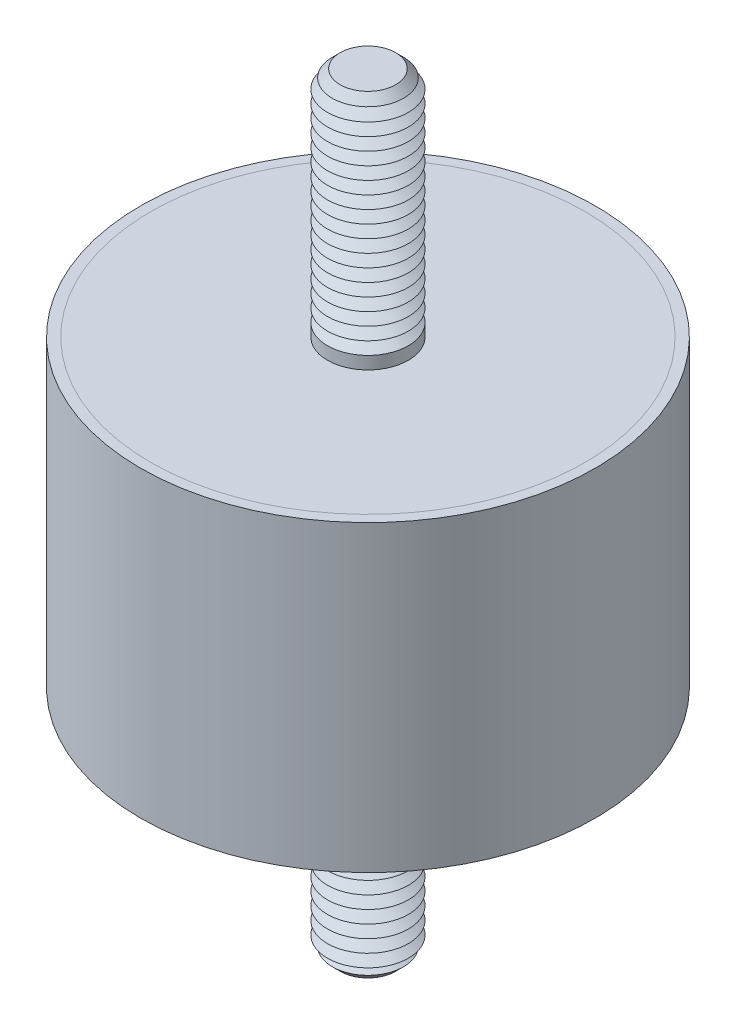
ISO-10303-21;
HEADER;
FILE_DESCRIPTION(('STEP AP214'),'2;1');
FILE_NAME('part.step','',(''),(''),'','','');
FILE_SCHEMA(('AUTOMOTIVE_DESIGN { 1 0 10303 214 1 1 1 1 }'));
ENDSEC;
DATA;
#1=APPLICATION_CONTEXT('core data for automotive mechanical design processes');
#2=APPLICATION_PROTOCOL_DEFINITION('international standard','automotive_design',2000,#1);
#3=PRODUCT_CONTEXT('',#1,'mechanical');
#4=PRODUCT('Part','Part','',(#3));
#5=PRODUCT_RELATED_PRODUCT_CATEGORY('part','',(#4));
#6=PRODUCT_DEFINITION_FORMATION('','',#4);
#7=PRODUCT_DEFINITION_CONTEXT('part definition',#1,'design');
#8=PRODUCT_DEFINITION('design','',#6,#7);
#9=PRODUCT_DEFINITION_SHAPE('','',#8);
#10=(LENGTH_UNIT() NAMED_UNIT(*) SI_UNIT(.MILLI.,.METRE.));
#11=(NAMED_UNIT(*) PLANE_ANGLE_UNIT() SI_UNIT($,.RADIAN.));
#12=(NAMED_UNIT(*) SI_UNIT($,.STERADIAN.) SOLID_ANGLE_UNIT());
#13=UNCERTAINTY_MEASURE_WITH_UNIT(LENGTH_MEASURE(1.E-05),#10,'distance_accuracy_value','');
#14=(GEOMETRIC_REPRESENTATION_CONTEXT(3) GLOBAL_UNCERTAINTY_ASSIGNED_CONTEXT((#13)) GLOBAL_UNIT_ASSIGNED_CONTEXT((#10,
#11,#12)) REPRESENTATION_CONTEXT('',''));
#15=CARTESIAN_POINT('',(0.,0.,0.));
#16=DIRECTION('',(0.,0.,1.));
#17=DIRECTION('',(1.,0.,0.));
#18=AXIS2_PLACEMENT_3D('',#15,#16,#17);
#19=CARTESIAN_POINT('',(0.,-38.,0.));
#20=DIRECTION('',(0.,1.,0.));
#21=DIRECTION('',(0.,0.,1.));
#22=AXIS2_PLACEMENT_3D('',#19,#20,#21);
#23=CYLINDRICAL_SURFACE('',#22,4.);
#24=CARTESIAN_POINT('',(0.,-15.,0.));
#25=DIRECTION('',(0.,-1.,0.));
#26=DIRECTION('',(0.,0.,-1.));
#27=AXIS2_PLACEMENT_3D('',#24,#25,#26);
#28=CIRCLE('',#27,4.);
#29=CARTESIAN_POINT('',(0.,-15.,-4.));
#30=VERTEX_POINT('',#29);
#31=EDGE_CURVE('P0_E22',#30,#30,#28,.T.);
#32=ORIENTED_EDGE('',*,*,#31,.T.);
#33=EDGE_LOOP('',(#32));
#34=FACE_BOUND('',#33,.T.);
#35=CARTESIAN_POINT('',(0.,-16.25,0.));
#36=DIRECTION('',(0.,1.,0.));
#37=DIRECTION('',(0.,0.,1.));
#38=AXIS2_PLACEMENT_3D('',#35,#36,#37);
#39=CIRCLE('',#38,4.);
#40=CARTESIAN_POINT('',(0.,-16.25,4.));
#41=VERTEX_POINT('',#40);
#42=EDGE_CURVE('P0_E32',#41,#41,#39,.T.);
#43=ORIENTED_EDGE('',*,*,#42,.T.);
#44=EDGE_LOOP('',(#43));
#45=FACE_BOUND('',#44,.T.);
#46=ADVANCED_FACE('P0_F14',(#34,#45),#23,.T.);
#47=CARTESIAN_POINT('',(0.,-15.,0.));
#48=DIRECTION('',(0.,1.,0.));
#49=DIRECTION('',(0.,0.,1.));
#50=AXIS2_PLACEMENT_3D('',#47,#48,#49);
#51=CYLINDRICAL_SURFACE('',#50,21.5);
#52=CARTESIAN_POINT('',(0.,-15.,0.));
#53=DIRECTION('',(0.,1.,0.));
#54=DIRECTION('',(0.,0.,1.));
#55=AXIS2_PLACEMENT_3D('',#52,#53,#54);
#56=CIRCLE('',#55,21.5);
#57=CARTESIAN_POINT('',(0.,-15.,21.5));
#58=VERTEX_POINT('',#57);
#59=EDGE_CURVE('P0_E26',#58,#58,#56,.T.);
#60=ORIENTED_EDGE('',*,*,#59,.T.);
#61=EDGE_LOOP('',(#60));
#62=FACE_BOUND('',#61,.T.);
#63=CARTESIAN_POINT('',(0.,-13.5,0.));
#64=DIRECTION('',(0.,1.,0.));
#65=DIRECTION('',(0.,0.,1.));
#66=AXIS2_PLACEMENT_3D('',#63,#64,#65);
#67=CIRCLE('',#66,21.5);
#68=CARTESIAN_POINT('',(0.,-13.5,21.5));
#69=VERTEX_POINT('',#68);
#70=EDGE_CURVE('P0_E29',#69,#69,#67,.T.);
#71=ORIENTED_EDGE('',*,*,#70,.F.);
#72=EDGE_LOOP('',(#71));
#73=FACE_BOUND('',#72,.T.);
#74=ADVANCED_FACE('P0_F155',(#62,#73),#51,.T.);
#75=CARTESIAN_POINT('',(0.,-15.,0.));
#76=DIRECTION('',(0.,1.,0.));
#77=DIRECTION('',(0.,0.,1.));
#78=AXIS2_PLACEMENT_3D('',#75,#76,#77);
#79=PLANE('',#78);
#80=ORIENTED_EDGE('',*,*,#31,.F.);
#81=EDGE_LOOP('',(#80));
#82=FACE_BOUND('',#81,.T.);
#83=ORIENTED_EDGE('',*,*,#59,.F.);
#84=EDGE_LOOP('',(#83));
#85=FACE_BOUND('',#84,.T.);
#86=ADVANCED_FACE('P0_F161',(#82,#85),#79,.F.);
#87=CARTESIAN_POINT('',(0.,-13.5,0.));
#88=DIRECTION('',(0.,1.,0.));
#89=DIRECTION('',(0.,0.,1.));
#90=AXIS2_PLACEMENT_3D('',#87,#88,#89);
#91=PLANE('',#90);
#92=ORIENTED_EDGE('',*,*,#70,.T.);
#93=EDGE_LOOP('',(#92));
#94=FACE_BOUND('',#93,.T.);
#95=ADVANCED_FACE('P0_F168',(#94),#91,.T.);
#96=CARTESIAN_POINT('',(0.,-16.25,0.));
#97=DIRECTION('',(0.,1.,0.));
#98=DIRECTION('',(0.,0.,1.));
#99=AXIS2_PLACEMENT_3D('',#96,#97,#98);
#100=CONICAL_SURFACE('',#99,4.,1.0471975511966);
#101=CARTESIAN_POINT('',(0.,-16.875,0.));
#102=DIRECTION('',(0.,1.,0.));
#103=DIRECTION('',(0.,0.,1.));
#104=AXIS2_PLACEMENT_3D('',#101,#102,#103);
#105=CIRCLE('',#104,2.91746824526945);
#106=CARTESIAN_POINT('',(0.,-16.875,2.91746824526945));
#107=VERTEX_POINT('',#106);
#108=EDGE_CURVE('P0_E37',#107,#107,#105,.T.);
#109=ORIENTED_EDGE('',*,*,#108,.T.);
#110=EDGE_LOOP('',(#109));
#111=FACE_BOUND('',#110,.T.);
#112=ORIENTED_EDGE('',*,*,#42,.F.);
#113=EDGE_LOOP('',(#112));
#114=FACE_BOUND('',#113,.T.);
#115=ADVANCED_FACE('P0_F171',(#111,#114),#100,.T.);
#116=CARTESIAN_POINT('',(0.,-16.875,0.));
#117=DIRECTION('',(0.,-1.,0.));
#118=DIRECTION('',(0.,0.,-1.));
#119=AXIS2_PLACEMENT_3D('',#116,#117,#118);
#120=CONICAL_SURFACE('',#119,2.91746824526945,1.0471975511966);
#121=CARTESIAN_POINT('',(0.,-17.5,0.));
#122=DIRECTION('',(0.,1.,0.));
#123=DIRECTION('',(0.,0.,1.));
#124=AXIS2_PLACEMENT_3D('',#121,#122,#123);
#125=CIRCLE('',#124,4.);
#126=CARTESIAN_POINT('',(0.,-17.5,4.));
#127=VERTEX_POINT('',#126);
#128=EDGE_CURVE('P0_E40',#127,#127,#125,.T.);
#129=ORIENTED_EDGE('',*,*,#128,.T.);
#130=EDGE_LOOP('',(#129));
#131=FACE_BOUND('',#130,.T.);
#132=ORIENTED_EDGE('',*,*,#108,.F.);
#133=EDGE_LOOP('',(#132));
#134=FACE_BOUND('',#133,.T.);
#135=ADVANCED_FACE('P0_F176',(#131,#134),#120,.T.);
#136=CARTESIAN_POINT('',(0.,-17.5,0.));
#137=DIRECTION('',(0.,1.,0.));
#138=DIRECTION('',(0.,0.,1.));
#139=AXIS2_PLACEMENT_3D('',#136,#137,#138);
#140=CONICAL_SURFACE('',#139,4.,1.0471975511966);
#141=CARTESIAN_POINT('',(0.,-18.125,0.));
#142=DIRECTION('',(0.,1.,0.));
#143=DIRECTION('',(0.,0.,1.));
#144=AXIS2_PLACEMENT_3D('',#141,#142,#143);
#145=CIRCLE('',#144,2.91746824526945);
#146=CARTESIAN_POINT('',(0.,-18.125,2.91746824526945));
#147=VERTEX_POINT('',#146);
#148=EDGE_CURVE('P0_E43',#147,#147,#145,.T.);
#149=ORIENTED_EDGE('',*,*,#148,.T.);
#150=EDGE_LOOP('',(#149));
#151=FACE_BOUND('',#150,.T.);
#152=ORIENTED_EDGE('',*,*,#128,.F.);
#153=EDGE_LOOP('',(#152));
#154=FACE_BOUND('',#153,.T.);
#155=ADVANCED_FACE('P0_F183',(#151,#154),#140,.T.);
#156=CARTESIAN_POINT('',(0.,-18.125,0.));
#157=DIRECTION('',(0.,-1.,0.));
#158=DIRECTION('',(0.,0.,-1.));
#159=AXIS2_PLACEMENT_3D('',#156,#157,#158);
#160=CONICAL_SURFACE('',#159,2.91746824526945,1.0471975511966);
#161=CARTESIAN_POINT('',(0.,-18.75,0.));
#162=DIRECTION('',(0.,1.,0.));
#163=DIRECTION('',(0.,0.,1.));
#164=AXIS2_PLACEMENT_3D('',#161,#162,#163);
#165=CIRCLE('',#164,4.);
#166=CARTESIAN_POINT('',(0.,-18.75,4.));
#167=VERTEX_POINT('',#166);
#168=EDGE_CURVE('P0_E46',#167,#167,#165,.T.);
#169=ORIENTED_EDGE('',*,*,#168,.T.);
#170=EDGE_LOOP('',(#169));
#171=FACE_BOUND('',#170,.T.);
#172=ORIENTED_EDGE('',*,*,#148,.F.);
#173=EDGE_LOOP('',(#172));
#174=FACE_BOUND('',#173,.T.);
#175=ADVANCED_FACE('P0_F190',(#171,#174),#160,.T.);
#176=CARTESIAN_POINT('',(0.,-18.75,0.));
#177=DIRECTION('',(0.,1.,0.));
#178=DIRECTION('',(0.,0.,1.));
#179=AXIS2_PLACEMENT_3D('',#176,#177,#178);
#180=CONICAL_SURFACE('',#179,4.,1.0471975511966);
#181=CARTESIAN_POINT('',(0.,-19.375,0.));
#182=DIRECTION('',(0.,1.,0.));
#183=DIRECTION('',(0.,0.,1.));
#184=AXIS2_PLACEMENT_3D('',#181,#182,#183);
#185=CIRCLE('',#184,2.91746824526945);
#186=CARTESIAN_POINT('',(0.,-19.375,2.91746824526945));
#187=VERTEX_POINT('',#186);
#188=EDGE_CURVE('P0_E49',#187,#187,#185,.T.);
#189=ORIENTED_EDGE('',*,*,#188,.T.);
#190=EDGE_LOOP('',(#189));
#191=FACE_BOUND('',#190,.T.);
#192=ORIENTED_EDGE('',*,*,#168,.F.);
#193=EDGE_LOOP('',(#192));
#194=FACE_BOUND('',#193,.T.);
#195=ADVANCED_FACE('P0_F194',(#191,#194),#180,.T.);
#196=CARTESIAN_POINT('',(0.,-19.375,0.));
#197=DIRECTION('',(0.,-1.,0.));
#198=DIRECTION('',(0.,0.,-1.));
#199=AXIS2_PLACEMENT_3D('',#196,#197,#198);
#200=CONICAL_SURFACE('',#199,2.91746824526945,1.0471975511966);
#201=CARTESIAN_POINT('',(0.,-20.,0.));
#202=DIRECTION('',(0.,1.,0.));
#203=DIRECTION('',(0.,0.,1.));
#204=AXIS2_PLACEMENT_3D('',#201,#202,#203);
#205=CIRCLE('',#204,4.);
#206=CARTESIAN_POINT('',(0.,-20.,4.));
#207=VERTEX_POINT('',#206);
#208=EDGE_CURVE('P0_E52',#207,#207,#205,.T.);
#209=ORIENTED_EDGE('',*,*,#208,.T.);
#210=EDGE_LOOP('',(#209));
#211=FACE_BOUND('',#210,.T.);
#212=ORIENTED_EDGE('',*,*,#188,.F.);
#213=EDGE_LOOP('',(#212));
#214=FACE_BOUND('',#213,.T.);
#215=ADVANCED_FACE('P0_F198',(#211,#214),#200,.T.);
#216=CARTESIAN_POINT('',(0.,-20.,0.));
#217=DIRECTION('',(0.,1.,0.));
#218=DIRECTION('',(0.,0.,1.));
#219=AXIS2_PLACEMENT_3D('',#216,#217,#218);
#220=CONICAL_SURFACE('',#219,4.,1.0471975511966);
#221=CARTESIAN_POINT('',(0.,-20.625,0.));
#222=DIRECTION('',(0.,1.,0.));
#223=DIRECTION('',(0.,0.,1.));
#224=AXIS2_PLACEMENT_3D('',#221,#222,#223);
#225=CIRCLE('',#224,2.91746824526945);
#226=CARTESIAN_POINT('',(0.,-20.625,2.91746824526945));
#227=VERTEX_POINT('',#226);
#228=EDGE_CURVE('P0_E55',#227,#227,#225,.T.);
#229=ORIENTED_EDGE('',*,*,#228,.T.);
#230=EDGE_LOOP('',(#229));
#231=FACE_BOUND('',#230,.T.);
#232=ORIENTED_EDGE('',*,*,#208,.F.);
#233=EDGE_LOOP('',(#232));
#234=FACE_BOUND('',#233,.T.);
#235=ADVANCED_FACE('P0_F202',(#231,#234),#220,.T.);
#236=CARTESIAN_POINT('',(0.,-20.625,0.));
#237=DIRECTION('',(0.,-1.,0.));
#238=DIRECTION('',(0.,0.,-1.));
#239=AXIS2_PLACEMENT_3D('',#236,#237,#238);
#240=CONICAL_SURFACE('',#239,2.91746824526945,1.0471975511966);
#241=CARTESIAN_POINT('',(0.,-21.25,0.));
#242=DIRECTION('',(0.,1.,0.));
#243=DIRECTION('',(0.,0.,1.));
#244=AXIS2_PLACEMENT_3D('',#241,#242,#243);
#245=CIRCLE('',#244,4.);
#246=CARTESIAN_POINT('',(0.,-21.25,4.));
#247=VERTEX_POINT('',#246);
#248=EDGE_CURVE('P0_E58',#247,#247,#245,.T.);
#249=ORIENTED_EDGE('',*,*,#248,.T.);
#250=EDGE_LOOP('',(#249));
#251=FACE_BOUND('',#250,.T.);
#252=ORIENTED_EDGE('',*,*,#228,.F.);
#253=EDGE_LOOP('',(#252));
#254=FACE_BOUND('',#253,.T.);
#255=ADVANCED_FACE('P0_F206',(#251,#254),#240,.T.);
#256=CARTESIAN_POINT('',(0.,-21.25,0.));
#257=DIRECTION('',(0.,1.,0.));
#258=DIRECTION('',(0.,0.,1.));
#259=AXIS2_PLACEMENT_3D('',#256,#257,#258);
#260=CONICAL_SURFACE('',#259,4.,1.0471975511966);
#261=CARTESIAN_POINT('',(0.,-21.875,0.));
#262=DIRECTION('',(0.,1.,0.));
#263=DIRECTION('',(0.,0.,1.));
#264=AXIS2_PLACEMENT_3D('',#261,#262,#263);
#265=CIRCLE('',#264,2.91746824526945);
#266=CARTESIAN_POINT('',(0.,-21.875,2.91746824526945));
#267=VERTEX_POINT('',#266);
#268=EDGE_CURVE('P0_E61',#267,#267,#265,.T.);
#269=ORIENTED_EDGE('',*,*,#268,.T.);
#270=EDGE_LOOP('',(#269));
#271=FACE_BOUND('',#270,.T.);
#272=ORIENTED_EDGE('',*,*,#248,.F.);
#273=EDGE_LOOP('',(#272));
#274=FACE_BOUND('',#273,.T.);
#275=ADVANCED_FACE('P0_F210',(#271,#274),#260,.T.);
#276=CARTESIAN_POINT('',(0.,-21.875,0.));
#277=DIRECTION('',(0.,-1.,0.));
#278=DIRECTION('',(0.,0.,-1.));
#279=AXIS2_PLACEMENT_3D('',#276,#277,#278);
#280=CONICAL_SURFACE('',#279,2.91746824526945,1.0471975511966);
#281=CARTESIAN_POINT('',(0.,-22.5,0.));
#282=DIRECTION('',(0.,1.,0.));
#283=DIRECTION('',(0.,0.,1.));
#284=AXIS2_PLACEMENT_3D('',#281,#282,#283);
#285=CIRCLE('',#284,4.);
#286=CARTESIAN_POINT('',(0.,-22.5,4.));
#287=VERTEX_POINT('',#286);
#288=EDGE_CURVE('P0_E64',#287,#287,#285,.T.);
#289=ORIENTED_EDGE('',*,*,#288,.T.);
#290=EDGE_LOOP('',(#289));
#291=FACE_BOUND('',#290,.T.);
#292=ORIENTED_EDGE('',*,*,#268,.F.);
#293=EDGE_LOOP('',(#292));
#294=FACE_BOUND('',#293,.T.);
#295=ADVANCED_FACE('P0_F214',(#291,#294),#280,.T.);
#296=CARTESIAN_POINT('',(0.,-22.5,0.));
#297=DIRECTION('',(0.,1.,0.));
#298=DIRECTION('',(0.,0.,1.));
#299=AXIS2_PLACEMENT_3D('',#296,#297,#298);
#300=CONICAL_SURFACE('',#299,4.,1.0471975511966);
#301=CARTESIAN_POINT('',(0.,-23.125,0.));
#302=DIRECTION('',(0.,1.,0.));
#303=DIRECTION('',(0.,0.,1.));
#304=AXIS2_PLACEMENT_3D('',#301,#302,#303);
#305=CIRCLE('',#304,2.91746824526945);
#306=CARTESIAN_POINT('',(0.,-23.125,2.91746824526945));
#307=VERTEX_POINT('',#306);
#308=EDGE_CURVE('P0_E67',#307,#307,#305,.T.);
#309=ORIENTED_EDGE('',*,*,#308,.T.);
#310=EDGE_LOOP('',(#309));
#311=FACE_BOUND('',#310,.T.);
#312=ORIENTED_EDGE('',*,*,#288,.F.);
#313=EDGE_LOOP('',(#312));
#314=FACE_BOUND('',#313,.T.);
#315=ADVANCED_FACE('P0_F218',(#311,#314),#300,.T.);
#316=CARTESIAN_POINT('',(0.,-23.125,0.));
#317=DIRECTION('',(0.,-1.,0.));
#318=DIRECTION('',(0.,0.,-1.));
#319=AXIS2_PLACEMENT_3D('',#316,#317,#318);
#320=CONICAL_SURFACE('',#319,2.91746824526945,1.0471975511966);
#321=CARTESIAN_POINT('',(0.,-23.75,0.));
#322=DIRECTION('',(0.,1.,0.));
#323=DIRECTION('',(0.,0.,1.));
#324=AXIS2_PLACEMENT_3D('',#321,#322,#323);
#325=CIRCLE('',#324,4.);
#326=CARTESIAN_POINT('',(0.,-23.75,4.));
#327=VERTEX_POINT('',#326);
#328=EDGE_CURVE('P0_E70',#327,#327,#325,.T.);
#329=ORIENTED_EDGE('',*,*,#328,.T.);
#330=EDGE_LOOP('',(#329));
#331=FACE_BOUND('',#330,.T.);
#332=ORIENTED_EDGE('',*,*,#308,.F.);
#333=EDGE_LOOP('',(#332));
#334=FACE_BOUND('',#333,.T.);
#335=ADVANCED_FACE('P0_F222',(#331,#334),#320,.T.);
#336=CARTESIAN_POINT('',(0.,-23.75,0.));
#337=DIRECTION('',(0.,1.,0.));
#338=DIRECTION('',(0.,0.,1.));
#339=AXIS2_PLACEMENT_3D('',#336,#337,#338);
#340=CONICAL_SURFACE('',#339,4.,1.0471975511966);
#341=CARTESIAN_POINT('',(0.,-24.375,0.));
#342=DIRECTION('',(0.,1.,0.));
#343=DIRECTION('',(0.,0.,1.));
#344=AXIS2_PLACEMENT_3D('',#341,#342,#343);
#345=CIRCLE('',#344,2.91746824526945);
#346=CARTESIAN_POINT('',(0.,-24.375,2.91746824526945));
#347=VERTEX_POINT('',#346);
#348=EDGE_CURVE('P0_E73',#347,#347,#345,.T.);
#349=ORIENTED_EDGE('',*,*,#348,.T.);
#350=EDGE_LOOP('',(#349));
#351=FACE_BOUND('',#350,.T.);
#352=ORIENTED_EDGE('',*,*,#328,.F.);
#353=EDGE_LOOP('',(#352));
#354=FACE_BOUND('',#353,.T.);
#355=ADVANCED_FACE('P0_F226',(#351,#354),#340,.T.);
#356=CARTESIAN_POINT('',(0.,-24.375,0.));
#357=DIRECTION('',(0.,-1.,0.));
#358=DIRECTION('',(0.,0.,-1.));
#359=AXIS2_PLACEMENT_3D('',#356,#357,#358);
#360=CONICAL_SURFACE('',#359,2.91746824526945,1.0471975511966);
#361=CARTESIAN_POINT('',(0.,-25.,0.));
#362=DIRECTION('',(0.,1.,0.));
#363=DIRECTION('',(0.,0.,1.));
#364=AXIS2_PLACEMENT_3D('',#361,#362,#363);
#365=CIRCLE('',#364,4.);
#366=CARTESIAN_POINT('',(0.,-25.,4.));
#367=VERTEX_POINT('',#366);
#368=EDGE_CURVE('P0_E76',#367,#367,#365,.T.);
#369=ORIENTED_EDGE('',*,*,#368,.T.);
#370=EDGE_LOOP('',(#369));
#371=FACE_BOUND('',#370,.T.);
#372=ORIENTED_EDGE('',*,*,#348,.F.);
#373=EDGE_LOOP('',(#372));
#374=FACE_BOUND('',#373,.T.);
#375=ADVANCED_FACE('P0_F230',(#371,#374),#360,.T.);
#376=CARTESIAN_POINT('',(0.,-25.,0.));
#377=DIRECTION('',(0.,1.,0.));
#378=DIRECTION('',(0.,0.,1.));
#379=AXIS2_PLACEMENT_3D('',#376,#377,#378);
#380=CONICAL_SURFACE('',#379,4.,1.0471975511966);
#381=CARTESIAN_POINT('',(0.,-25.625,0.));
#382=DIRECTION('',(0.,1.,0.));
#383=DIRECTION('',(0.,0.,1.));
#384=AXIS2_PLACEMENT_3D('',#381,#382,#383);
#385=CIRCLE('',#384,2.91746824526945);
#386=CARTESIAN_POINT('',(0.,-25.625,2.91746824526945));
#387=VERTEX_POINT('',#386);
#388=EDGE_CURVE('P0_E79',#387,#387,#385,.T.);
#389=ORIENTED_EDGE('',*,*,#388,.T.);
#390=EDGE_LOOP('',(#389));
#391=FACE_BOUND('',#390,.T.);
#392=ORIENTED_EDGE('',*,*,#368,.F.);
#393=EDGE_LOOP('',(#392));
#394=FACE_BOUND('',#393,.T.);
#395=ADVANCED_FACE('P0_F234',(#391,#394),#380,.T.);
#396=CARTESIAN_POINT('',(0.,-25.625,0.));
#397=DIRECTION('',(0.,-1.,0.));
#398=DIRECTION('',(0.,0.,-1.));
#399=AXIS2_PLACEMENT_3D('',#396,#397,#398);
#400=CONICAL_SURFACE('',#399,2.91746824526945,1.0471975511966);
#401=CARTESIAN_POINT('',(0.,-26.25,0.));
#402=DIRECTION('',(0.,1.,0.));
#403=DIRECTION('',(0.,0.,1.));
#404=AXIS2_PLACEMENT_3D('',#401,#402,#403);
#405=CIRCLE('',#404,4.);
#406=CARTESIAN_POINT('',(0.,-26.25,4.));
#407=VERTEX_POINT('',#406);
#408=EDGE_CURVE('P0_E82',#407,#407,#405,.T.);
#409=ORIENTED_EDGE('',*,*,#408,.T.);
#410=EDGE_LOOP('',(#409));
#411=FACE_BOUND('',#410,.T.);
#412=ORIENTED_EDGE('',*,*,#388,.F.);
#413=EDGE_LOOP('',(#412));
#414=FACE_BOUND('',#413,.T.);
#415=ADVANCED_FACE('P0_F238',(#411,#414),#400,.T.);
#416=CARTESIAN_POINT('',(0.,-26.25,0.));
#417=DIRECTION('',(0.,1.,0.));
#418=DIRECTION('',(0.,0.,1.));
#419=AXIS2_PLACEMENT_3D('',#416,#417,#418);
#420=CONICAL_SURFACE('',#419,4.,1.0471975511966);
#421=CARTESIAN_POINT('',(0.,-26.875,0.));
#422=DIRECTION('',(0.,1.,0.));
#423=DIRECTION('',(0.,0.,1.));
#424=AXIS2_PLACEMENT_3D('',#421,#422,#423);
#425=CIRCLE('',#424,2.91746824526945);
#426=CARTESIAN_POINT('',(0.,-26.875,2.91746824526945));
#427=VERTEX_POINT('',#426);
#428=EDGE_CURVE('P0_E85',#427,#427,#425,.T.);
#429=ORIENTED_EDGE('',*,*,#428,.T.);
#430=EDGE_LOOP('',(#429));
#431=FACE_BOUND('',#430,.T.);
#432=ORIENTED_EDGE('',*,*,#408,.F.);
#433=EDGE_LOOP('',(#432));
#434=FACE_BOUND('',#433,.T.);
#435=ADVANCED_FACE('P0_F242',(#431,#434),#420,.T.);
#436=CARTESIAN_POINT('',(0.,-26.875,0.));
#437=DIRECTION('',(0.,-1.,0.));
#438=DIRECTION('',(0.,0.,-1.));
#439=AXIS2_PLACEMENT_3D('',#436,#437,#438);
#440=CONICAL_SURFACE('',#439,2.91746824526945,1.0471975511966);
#441=CARTESIAN_POINT('',(0.,-27.5,0.));
#442=DIRECTION('',(0.,1.,0.));
#443=DIRECTION('',(0.,0.,1.));
#444=AXIS2_PLACEMENT_3D('',#441,#442,#443);
#445=CIRCLE('',#444,4.);
#446=CARTESIAN_POINT('',(0.,-27.5,4.));
#447=VERTEX_POINT('',#446);
#448=EDGE_CURVE('P0_E88',#447,#447,#445,.T.);
#449=ORIENTED_EDGE('',*,*,#448,.T.);
#450=EDGE_LOOP('',(#449));
#451=FACE_BOUND('',#450,.T.);
#452=ORIENTED_EDGE('',*,*,#428,.F.);
#453=EDGE_LOOP('',(#452));
#454=FACE_BOUND('',#453,.T.);
#455=ADVANCED_FACE('P0_F246',(#451,#454),#440,.T.);
#456=CARTESIAN_POINT('',(0.,-27.5,0.));
#457=DIRECTION('',(0.,1.,0.));
#458=DIRECTION('',(0.,0.,1.));
#459=AXIS2_PLACEMENT_3D('',#456,#457,#458);
#460=CONICAL_SURFACE('',#459,4.,1.0471975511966);
#461=CARTESIAN_POINT('',(0.,-28.125,0.));
#462=DIRECTION('',(0.,1.,0.));
#463=DIRECTION('',(0.,0.,1.));
#464=AXIS2_PLACEMENT_3D('',#461,#462,#463);
#465=CIRCLE('',#464,2.91746824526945);
#466=CARTESIAN_POINT('',(0.,-28.125,2.91746824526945));
#467=VERTEX_POINT('',#466);
#468=EDGE_CURVE('P0_E91',#467,#467,#465,.T.);
#469=ORIENTED_EDGE('',*,*,#468,.T.);
#470=EDGE_LOOP('',(#469));
#471=FACE_BOUND('',#470,.T.);
#472=ORIENTED_EDGE('',*,*,#448,.F.);
#473=EDGE_LOOP('',(#472));
#474=FACE_BOUND('',#473,.T.);
#475=ADVANCED_FACE('P0_F250',(#471,#474),#460,.T.);
#476=CARTESIAN_POINT('',(0.,-28.125,0.));
#477=DIRECTION('',(0.,-1.,0.));
#478=DIRECTION('',(0.,0.,-1.));
#479=AXIS2_PLACEMENT_3D('',#476,#477,#478);
#480=CONICAL_SURFACE('',#479,2.91746824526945,1.0471975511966);
#481=CARTESIAN_POINT('',(0.,-28.75,0.));
#482=DIRECTION('',(0.,1.,0.));
#483=DIRECTION('',(0.,0.,1.));
#484=AXIS2_PLACEMENT_3D('',#481,#482,#483);
#485=CIRCLE('',#484,4.);
#486=CARTESIAN_POINT('',(0.,-28.75,4.));
#487=VERTEX_POINT('',#486);
#488=EDGE_CURVE('P0_E94',#487,#487,#485,.T.);
#489=ORIENTED_EDGE('',*,*,#488,.T.);
#490=EDGE_LOOP('',(#489));
#491=FACE_BOUND('',#490,.T.);
#492=ORIENTED_EDGE('',*,*,#468,.F.);
#493=EDGE_LOOP('',(#492));
#494=FACE_BOUND('',#493,.T.);
#495=ADVANCED_FACE('P0_F254',(#491,#494),#480,.T.);
#496=CARTESIAN_POINT('',(0.,-28.75,0.));
#497=DIRECTION('',(0.,1.,0.));
#498=DIRECTION('',(0.,0.,1.));
#499=AXIS2_PLACEMENT_3D('',#496,#497,#498);
#500=CONICAL_SURFACE('',#499,4.,1.0471975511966);
#501=CARTESIAN_POINT('',(0.,-29.375,0.));
#502=DIRECTION('',(0.,1.,0.));
#503=DIRECTION('',(0.,0.,1.));
#504=AXIS2_PLACEMENT_3D('',#501,#502,#503);
#505=CIRCLE('',#504,2.91746824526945);
#506=CARTESIAN_POINT('',(0.,-29.375,2.91746824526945));
#507=VERTEX_POINT('',#506);
#508=EDGE_CURVE('P0_E97',#507,#507,#505,.T.);
#509=ORIENTED_EDGE('',*,*,#508,.T.);
#510=EDGE_LOOP('',(#509));
#511=FACE_BOUND('',#510,.T.);
#512=ORIENTED_EDGE('',*,*,#488,.F.);
#513=EDGE_LOOP('',(#512));
#514=FACE_BOUND('',#513,.T.);
#515=ADVANCED_FACE('P0_F258',(#511,#514),#500,.T.);
#516=CARTESIAN_POINT('',(0.,-29.375,0.));
#517=DIRECTION('',(0.,-1.,0.));
#518=DIRECTION('',(0.,0.,-1.));
#519=AXIS2_PLACEMENT_3D('',#516,#517,#518);
#520=CONICAL_SURFACE('',#519,2.91746824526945,1.0471975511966);
#521=CARTESIAN_POINT('',(0.,-30.,0.));
#522=DIRECTION('',(0.,1.,0.));
#523=DIRECTION('',(0.,0.,1.));
#524=AXIS2_PLACEMENT_3D('',#521,#522,#523);
#525=CIRCLE('',#524,4.);
#526=CARTESIAN_POINT('',(0.,-30.,4.));
#527=VERTEX_POINT('',#526);
#528=EDGE_CURVE('P0_E100',#527,#527,#525,.T.);
#529=ORIENTED_EDGE('',*,*,#528,.T.);
#530=EDGE_LOOP('',(#529));
#531=FACE_BOUND('',#530,.T.);
#532=ORIENTED_EDGE('',*,*,#508,.F.);
#533=EDGE_LOOP('',(#532));
#534=FACE_BOUND('',#533,.T.);
#535=ADVANCED_FACE('P0_F262',(#531,#534),#520,.T.);
#536=CARTESIAN_POINT('',(0.,-30.,0.));
#537=DIRECTION('',(0.,1.,0.));
#538=DIRECTION('',(0.,0.,1.));
#539=AXIS2_PLACEMENT_3D('',#536,#537,#538);
#540=CONICAL_SURFACE('',#539,4.,1.0471975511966);
#541=CARTESIAN_POINT('',(0.,-30.625,0.));
#542=DIRECTION('',(0.,1.,0.));
#543=DIRECTION('',(0.,0.,1.));
#544=AXIS2_PLACEMENT_3D('',#541,#542,#543);
#545=CIRCLE('',#544,2.91746824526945);
#546=CARTESIAN_POINT('',(0.,-30.625,2.91746824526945));
#547=VERTEX_POINT('',#546);
#548=EDGE_CURVE('P0_E103',#547,#547,#545,.T.);
#549=ORIENTED_EDGE('',*,*,#548,.T.);
#550=EDGE_LOOP('',(#549));
#551=FACE_BOUND('',#550,.T.);
#552=ORIENTED_EDGE('',*,*,#528,.F.);
#553=EDGE_LOOP('',(#552));
#554=FACE_BOUND('',#553,.T.);
#555=ADVANCED_FACE('P0_F266',(#551,#554),#540,.T.);
#556=CARTESIAN_POINT('',(0.,-30.625,0.));
#557=DIRECTION('',(0.,-1.,0.));
#558=DIRECTION('',(0.,0.,-1.));
#559=AXIS2_PLACEMENT_3D('',#556,#557,#558);
#560=CONICAL_SURFACE('',#559,2.91746824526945,1.0471975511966);
#561=CARTESIAN_POINT('',(0.,-31.25,0.));
#562=DIRECTION('',(0.,1.,0.));
#563=DIRECTION('',(0.,0.,1.));
#564=AXIS2_PLACEMENT_3D('',#561,#562,#563);
#565=CIRCLE('',#564,4.);
#566=CARTESIAN_POINT('',(0.,-31.25,4.));
#567=VERTEX_POINT('',#566);
#568=EDGE_CURVE('P0_E106',#567,#567,#565,.T.);
#569=ORIENTED_EDGE('',*,*,#568,.T.);
#570=EDGE_LOOP('',(#569));
#571=FACE_BOUND('',#570,.T.);
#572=ORIENTED_EDGE('',*,*,#548,.F.);
#573=EDGE_LOOP('',(#572));
#574=FACE_BOUND('',#573,.T.);
#575=ADVANCED_FACE('P0_F270',(#571,#574),#560,.T.);
#576=CARTESIAN_POINT('',(0.,-31.25,0.));
#577=DIRECTION('',(0.,1.,0.));
#578=DIRECTION('',(0.,0.,1.));
#579=AXIS2_PLACEMENT_3D('',#576,#577,#578);
#580=CONICAL_SURFACE('',#579,4.,1.0471975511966);
#581=CARTESIAN_POINT('',(0.,-31.875,0.));
#582=DIRECTION('',(0.,1.,0.));
#583=DIRECTION('',(0.,0.,1.));
#584=AXIS2_PLACEMENT_3D('',#581,#582,#583);
#585=CIRCLE('',#584,2.91746824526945);
#586=CARTESIAN_POINT('',(0.,-31.875,2.91746824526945));
#587=VERTEX_POINT('',#586);
#588=EDGE_CURVE('P0_E109',#587,#587,#585,.T.);
#589=ORIENTED_EDGE('',*,*,#588,.T.);
#590=EDGE_LOOP('',(#589));
#591=FACE_BOUND('',#590,.T.);
#592=ORIENTED_EDGE('',*,*,#568,.F.);
#593=EDGE_LOOP('',(#592));
#594=FACE_BOUND('',#593,.T.);
#595=ADVANCED_FACE('P0_F274',(#591,#594),#580,.T.);
#596=CARTESIAN_POINT('',(0.,-31.875,0.));
#597=DIRECTION('',(0.,-1.,0.));
#598=DIRECTION('',(0.,0.,-1.));
#599=AXIS2_PLACEMENT_3D('',#596,#597,#598);
#600=CONICAL_SURFACE('',#599,2.91746824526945,1.0471975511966);
#601=CARTESIAN_POINT('',(0.,-32.5,0.));
#602=DIRECTION('',(0.,1.,0.));
#603=DIRECTION('',(0.,0.,1.));
#604=AXIS2_PLACEMENT_3D('',#601,#602,#603);
#605=CIRCLE('',#604,4.);
#606=CARTESIAN_POINT('',(0.,-32.5,4.));
#607=VERTEX_POINT('',#606);
#608=EDGE_CURVE('P0_E112',#607,#607,#605,.T.);
#609=ORIENTED_EDGE('',*,*,#608,.T.);
#610=EDGE_LOOP('',(#609));
#611=FACE_BOUND('',#610,.T.);
#612=ORIENTED_EDGE('',*,*,#588,.F.);
#613=EDGE_LOOP('',(#612));
#614=FACE_BOUND('',#613,.T.);
#615=ADVANCED_FACE('P0_F278',(#611,#614),#600,.T.);
#616=CARTESIAN_POINT('',(0.,-32.5,0.));
#617=DIRECTION('',(0.,1.,0.));
#618=DIRECTION('',(0.,0.,1.));
#619=AXIS2_PLACEMENT_3D('',#616,#617,#618);
#620=CONICAL_SURFACE('',#619,4.,1.0471975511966);
#621=CARTESIAN_POINT('',(0.,-33.125,0.));
#622=DIRECTION('',(0.,1.,0.));
#623=DIRECTION('',(0.,0.,1.));
#624=AXIS2_PLACEMENT_3D('',#621,#622,#623);
#625=CIRCLE('',#624,2.91746824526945);
#626=CARTESIAN_POINT('',(0.,-33.125,2.91746824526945));
#627=VERTEX_POINT('',#626);
#628=EDGE_CURVE('P0_E115',#627,#627,#625,.T.);
#629=ORIENTED_EDGE('',*,*,#628,.T.);
#630=EDGE_LOOP('',(#629));
#631=FACE_BOUND('',#630,.T.);
#632=ORIENTED_EDGE('',*,*,#608,.F.);
#633=EDGE_LOOP('',(#632));
#634=FACE_BOUND('',#633,.T.);
#635=ADVANCED_FACE('P0_F282',(#631,#634),#620,.T.);
#636=CARTESIAN_POINT('',(0.,-33.125,0.));
#637=DIRECTION('',(0.,-1.,0.));
#638=DIRECTION('',(0.,0.,-1.));
#639=AXIS2_PLACEMENT_3D('',#636,#637,#638);
#640=CONICAL_SURFACE('',#639,2.91746824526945,1.0471975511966);
#641=CARTESIAN_POINT('',(0.,-33.75,0.));
#642=DIRECTION('',(0.,1.,0.));
#643=DIRECTION('',(0.,0.,1.));
#644=AXIS2_PLACEMENT_3D('',#641,#642,#643);
#645=CIRCLE('',#644,4.);
#646=CARTESIAN_POINT('',(0.,-33.75,4.));
#647=VERTEX_POINT('',#646);
#648=EDGE_CURVE('P0_E118',#647,#647,#645,.T.);
#649=ORIENTED_EDGE('',*,*,#648,.T.);
#650=EDGE_LOOP('',(#649));
#651=FACE_BOUND('',#650,.T.);
#652=ORIENTED_EDGE('',*,*,#628,.F.);
#653=EDGE_LOOP('',(#652));
#654=FACE_BOUND('',#653,.T.);
#655=ADVANCED_FACE('P0_F286',(#651,#654),#640,.T.);
#656=CARTESIAN_POINT('',(0.,-33.75,0.));
#657=DIRECTION('',(0.,1.,0.));
#658=DIRECTION('',(0.,0.,1.));
#659=AXIS2_PLACEMENT_3D('',#656,#657,#658);
#660=CONICAL_SURFACE('',#659,4.,1.0471975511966);
#661=CARTESIAN_POINT('',(0.,-34.375,0.));
#662=DIRECTION('',(0.,1.,0.));
#663=DIRECTION('',(0.,0.,1.));
#664=AXIS2_PLACEMENT_3D('',#661,#662,#663);
#665=CIRCLE('',#664,2.91746824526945);
#666=CARTESIAN_POINT('',(0.,-34.375,2.91746824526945));
#667=VERTEX_POINT('',#666);
#668=EDGE_CURVE('P0_E121',#667,#667,#665,.T.);
#669=ORIENTED_EDGE('',*,*,#668,.T.);
#670=EDGE_LOOP('',(#669));
#671=FACE_BOUND('',#670,.T.);
#672=ORIENTED_EDGE('',*,*,#648,.F.);
#673=EDGE_LOOP('',(#672));
#674=FACE_BOUND('',#673,.T.);
#675=ADVANCED_FACE('P0_F290',(#671,#674),#660,.T.);
#676=CARTESIAN_POINT('',(0.,-34.375,0.));
#677=DIRECTION('',(0.,-1.,0.));
#678=DIRECTION('',(0.,0.,-1.));
#679=AXIS2_PLACEMENT_3D('',#676,#677,#678);
#680=CONICAL_SURFACE('',#679,2.91746824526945,1.0471975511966);
#681=CARTESIAN_POINT('',(0.,-35.,0.));
#682=DIRECTION('',(0.,1.,0.));
#683=DIRECTION('',(0.,0.,1.));
#684=AXIS2_PLACEMENT_3D('',#681,#682,#683);
#685=CIRCLE('',#684,4.);
#686=CARTESIAN_POINT('',(0.,-35.,4.));
#687=VERTEX_POINT('',#686);
#688=EDGE_CURVE('P0_E124',#687,#687,#685,.T.);
#689=ORIENTED_EDGE('',*,*,#688,.T.);
#690=EDGE_LOOP('',(#689));
#691=FACE_BOUND('',#690,.T.);
#692=ORIENTED_EDGE('',*,*,#668,.F.);
#693=EDGE_LOOP('',(#692));
#694=FACE_BOUND('',#693,.T.);
#695=ADVANCED_FACE('P0_F294',(#691,#694),#680,.T.);
#696=CARTESIAN_POINT('',(0.,-35.,0.));
#697=DIRECTION('',(0.,1.,0.));
#698=DIRECTION('',(0.,0.,1.));
#699=AXIS2_PLACEMENT_3D('',#696,#697,#698);
#700=CONICAL_SURFACE('',#699,4.,1.0471975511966);
#701=CARTESIAN_POINT('',(0.,-35.625,0.));
#702=DIRECTION('',(0.,1.,0.));
#703=DIRECTION('',(0.,0.,1.));
#704=AXIS2_PLACEMENT_3D('',#701,#702,#703);
#705=CIRCLE('',#704,2.91746824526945);
#706=CARTESIAN_POINT('',(0.,-35.625,2.91746824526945));
#707=VERTEX_POINT('',#706);
#708=EDGE_CURVE('P0_E127',#707,#707,#705,.T.);
#709=ORIENTED_EDGE('',*,*,#708,.T.);
#710=EDGE_LOOP('',(#709));
#711=FACE_BOUND('',#710,.T.);
#712=ORIENTED_EDGE('',*,*,#688,.F.);
#713=EDGE_LOOP('',(#712));
#714=FACE_BOUND('',#713,.T.);
#715=ADVANCED_FACE('P0_F298',(#711,#714),#700,.T.);
#716=CARTESIAN_POINT('',(0.,-35.625,0.));
#717=DIRECTION('',(0.,-1.,0.));
#718=DIRECTION('',(0.,0.,-1.));
#719=AXIS2_PLACEMENT_3D('',#716,#717,#718);
#720=CONICAL_SURFACE('',#719,2.91746824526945,1.0471975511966);
#721=CARTESIAN_POINT('',(0.,-36.25,0.));
#722=DIRECTION('',(0.,1.,0.));
#723=DIRECTION('',(0.,0.,1.));
#724=AXIS2_PLACEMENT_3D('',#721,#722,#723);
#725=CIRCLE('',#724,4.);
#726=CARTESIAN_POINT('',(0.,-36.25,4.));
#727=VERTEX_POINT('',#726);
#728=EDGE_CURVE('P0_E130',#727,#727,#725,.T.);
#729=ORIENTED_EDGE('',*,*,#728,.T.);
#730=EDGE_LOOP('',(#729));
#731=FACE_BOUND('',#730,.T.);
#732=ORIENTED_EDGE('',*,*,#708,.F.);
#733=EDGE_LOOP('',(#732));
#734=FACE_BOUND('',#733,.T.);
#735=ADVANCED_FACE('P0_F151',(#731,#734),#720,.T.);
#736=CARTESIAN_POINT('',(0.,-36.25,0.));
#737=DIRECTION('',(0.,1.,0.));
#738=DIRECTION('',(0.,0.,1.));
#739=AXIS2_PLACEMENT_3D('',#736,#737,#738);
#740=CONICAL_SURFACE('',#739,4.,1.0471975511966);
#741=CARTESIAN_POINT('',(0.,-36.875,0.));
#742=DIRECTION('',(0.,1.,0.));
#743=DIRECTION('',(0.,0.,1.));
#744=AXIS2_PLACEMENT_3D('',#741,#742,#743);
#745=CIRCLE('',#744,2.91746824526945);
#746=CARTESIAN_POINT('',(0.,-36.875,2.91746824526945));
#747=VERTEX_POINT('',#746);
#748=EDGE_CURVE('P0_E133',#747,#747,#745,.T.);
#749=ORIENTED_EDGE('',*,*,#748,.T.);
#750=EDGE_LOOP('',(#749));
#751=FACE_BOUND('',#750,.T.);
#752=ORIENTED_EDGE('',*,*,#728,.F.);
#753=EDGE_LOOP('',(#752));
#754=FACE_BOUND('',#753,.T.);
#755=ADVANCED_FACE('P0_F137',(#751,#754),#740,.T.);
#756=CARTESIAN_POINT('',(0.,-36.875,0.));
#757=DIRECTION('',(0.,-1.,0.));
#758=DIRECTION('',(0.,0.,-1.));
#759=AXIS2_PLACEMENT_3D('',#756,#757,#758);
#760=CONICAL_SURFACE('',#759,2.91746824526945,1.0471975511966);
#761=CARTESIAN_POINT('',(0.,-37.2254809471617,0.));
#762=DIRECTION('',(0.,-1.,0.));
#763=DIRECTION('',(0.,0.,-1.));
#764=AXIS2_PLACEMENT_3D('',#761,#762,#763);
#765=CIRCLE('',#764,3.52451905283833);
#766=CARTESIAN_POINT('',(0.,-37.2254809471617,-3.52451905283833));
#767=VERTEX_POINT('',#766);
#768=EDGE_CURVE('P0_E18',#767,#767,#765,.T.);
#769=ORIENTED_EDGE('',*,*,#768,.F.);
#770=EDGE_LOOP('',(#769));
#771=FACE_BOUND('',#770,.T.);
#772=ORIENTED_EDGE('',*,*,#748,.F.);
#773=EDGE_LOOP('',(#772));
#774=FACE_BOUND('',#773,.T.);
#775=ADVANCED_FACE('P0_F140',(#771,#774),#760,.T.);
#776=CARTESIAN_POINT('',(0.,-38.,0.));
#777=DIRECTION('',(0.,-1.,0.));
#778=DIRECTION('',(0.,0.,-1.));
#779=AXIS2_PLACEMENT_3D('',#776,#777,#778);
#780=PLANE('',#779);
#781=CARTESIAN_POINT('',(0.,-38.,0.));
#782=DIRECTION('',(0.,-1.,0.));
#783=DIRECTION('',(0.,0.,-1.));
#784=AXIS2_PLACEMENT_3D('',#781,#782,#783);
#785=CIRCLE('',#784,2.75000000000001);
#786=CARTESIAN_POINT('',(0.,-38.,-2.75000000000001));
#787=VERTEX_POINT('',#786);
#788=EDGE_CURVE('P0_E10',#787,#787,#785,.T.);
#789=ORIENTED_EDGE('',*,*,#788,.T.);
#790=EDGE_LOOP('',(#789));
#791=FACE_BOUND('',#790,.T.);
#792=ADVANCED_FACE('P0_F142',(#791),#780,.T.);
#793=CARTESIAN_POINT('',(0.,-38.,0.));
#794=DIRECTION('',(0.,1.,0.));
#795=DIRECTION('',(0.,0.,1.));
#796=AXIS2_PLACEMENT_3D('',#793,#794,#795);
#797=CONICAL_SURFACE('',#796,2.75000000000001,0.785398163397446);
#798=ORIENTED_EDGE('',*,*,#788,.F.);
#799=EDGE_LOOP('',(#798));
#800=FACE_BOUND('',#799,.T.);
#801=ORIENTED_EDGE('',*,*,#768,.T.);
#802=EDGE_LOOP('',(#801));
#803=FACE_BOUND('',#802,.T.);
#804=ADVANCED_FACE('P0_F16',(#800,#803),#797,.T.);
#805=CLOSED_SHELL('',(#46,#74,#86,#95,#115,#135,#155,#175,#195,#215,#235,#255,#275,#295,#315,
#335,#355,#375,#395,#415,#435,#455,#475,#495,#515,#535,#555,#575,#595,#615,#635,#655,#675,#695,
#715,#735,#755,#775,#792,#804));
#806=MANIFOLD_SOLID_BREP('P0_B1',#805);
#807=CARTESIAN_POINT('',(0.,38.,0.));
#808=DIRECTION('',(0.,-1.,0.));
#809=DIRECTION('',(0.,0.,-1.));
#810=AXIS2_PLACEMENT_3D('',#807,#808,#809);
#811=CYLINDRICAL_SURFACE('',#810,4.);
#812=CARTESIAN_POINT('',(0.,16.25,0.));
#813=DIRECTION('',(0.,1.,0.));
#814=DIRECTION('',(0.,0.,1.));
#815=AXIS2_PLACEMENT_3D('',#812,#813,#814);
#816=CIRCLE('',#815,4.);
#817=CARTESIAN_POINT('',(0.,16.25,4.));
#818=VERTEX_POINT('',#817);
#819=EDGE_CURVE('P1_E32',#818,#818,#816,.T.);
#820=ORIENTED_EDGE('',*,*,#819,.F.);
#821=EDGE_LOOP('',(#820));
#822=FACE_BOUND('',#821,.T.);
#823=CARTESIAN_POINT('',(0.,15.,0.));
#824=DIRECTION('',(0.,1.,0.));
#825=DIRECTION('',(0.,0.,1.));
#826=AXIS2_PLACEMENT_3D('',#823,#824,#825);
#827=CIRCLE('',#826,4.);
#828=CARTESIAN_POINT('',(0.,15.,4.));
#829=VERTEX_POINT('',#828);
#830=EDGE_CURVE('P1_E22',#829,#829,#827,.T.);
#831=ORIENTED_EDGE('',*,*,#830,.T.);
#832=EDGE_LOOP('',(#831));
#833=FACE_BOUND('',#832,.T.);
#834=ADVANCED_FACE('P1_F14',(#822,#833),#811,.T.);
#835=CARTESIAN_POINT('',(0.,15.,0.));
#836=DIRECTION('',(0.,-1.,0.));
#837=DIRECTION('',(0.,0.,-1.));
#838=AXIS2_PLACEMENT_3D('',#835,#836,#837);
#839=CYLINDRICAL_SURFACE('',#838,21.5);
#840=CARTESIAN_POINT('',(0.,15.,0.));
#841=DIRECTION('',(0.,1.,0.));
#842=DIRECTION('',(0.,0.,1.));
#843=AXIS2_PLACEMENT_3D('',#840,#841,#842);
#844=CIRCLE('',#843,21.5);
#845=CARTESIAN_POINT('',(0.,15.,21.5));
#846=VERTEX_POINT('',#845);
#847=EDGE_CURVE('P1_E26',#846,#846,#844,.T.);
#848=ORIENTED_EDGE('',*,*,#847,.F.);
#849=EDGE_LOOP('',(#848));
#850=FACE_BOUND('',#849,.T.);
#851=CARTESIAN_POINT('',(0.,13.5,0.));
#852=DIRECTION('',(0.,1.,0.));
#853=DIRECTION('',(0.,0.,1.));
#854=AXIS2_PLACEMENT_3D('',#851,#852,#853);
#855=CIRCLE('',#854,21.5);
#856=CARTESIAN_POINT('',(0.,13.5,21.5));
#857=VERTEX_POINT('',#856);
#858=EDGE_CURVE('P1_E29',#857,#857,#855,.T.);
#859=ORIENTED_EDGE('',*,*,#858,.T.);
#860=EDGE_LOOP('',(#859));
#861=FACE_BOUND('',#860,.T.);
#862=ADVANCED_FACE('P1_F340',(#850,#861),#839,.T.);
#863=CARTESIAN_POINT('',(0.,15.,0.));
#864=DIRECTION('',(0.,1.,0.));
#865=DIRECTION('',(0.,0.,1.));
#866=AXIS2_PLACEMENT_3D('',#863,#864,#865);
#867=PLANE('',#866);
#868=ORIENTED_EDGE('',*,*,#830,.F.);
#869=EDGE_LOOP('',(#868));
#870=FACE_BOUND('',#869,.T.);
#871=ORIENTED_EDGE('',*,*,#847,.T.);
#872=EDGE_LOOP('',(#871));
#873=FACE_BOUND('',#872,.T.);
#874=ADVANCED_FACE('P1_F344',(#870,#873),#867,.T.);
#875=CARTESIAN_POINT('',(0.,13.5,0.));
#876=DIRECTION('',(0.,1.,0.));
#877=DIRECTION('',(0.,0.,1.));
#878=AXIS2_PLACEMENT_3D('',#875,#876,#877);
#879=PLANE('',#878);
#880=ORIENTED_EDGE('',*,*,#858,.F.);
#881=EDGE_LOOP('',(#880));
#882=FACE_BOUND('',#881,.T.);
#883=ADVANCED_FACE('P1_F334',(#882),#879,.F.);
#884=CARTESIAN_POINT('',(0.,16.25,0.));
#885=DIRECTION('',(0.,-1.,0.));
#886=DIRECTION('',(0.,0.,-1.));
#887=AXIS2_PLACEMENT_3D('',#884,#885,#886);
#888=CONICAL_SURFACE('',#887,4.,1.0471975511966);
#889=CARTESIAN_POINT('',(0.,16.875,0.));
#890=DIRECTION('',(0.,1.,0.));
#891=DIRECTION('',(0.,0.,1.));
#892=AXIS2_PLACEMENT_3D('',#889,#890,#891);
#893=CIRCLE('',#892,2.91746824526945);
#894=CARTESIAN_POINT('',(0.,16.875,2.91746824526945));
#895=VERTEX_POINT('',#894);
#896=EDGE_CURVE('P1_E37',#895,#895,#893,.T.);
#897=ORIENTED_EDGE('',*,*,#896,.F.);
#898=EDGE_LOOP('',(#897));
#899=FACE_BOUND('',#898,.T.);
#900=ORIENTED_EDGE('',*,*,#819,.T.);
#901=EDGE_LOOP('',(#900));
#902=FACE_BOUND('',#901,.T.);
#903=ADVANCED_FACE('P1_F328',(#899,#902),#888,.T.);
#904=CARTESIAN_POINT('',(0.,16.875,0.));
#905=DIRECTION('',(0.,1.,0.));
#906=DIRECTION('',(0.,0.,1.));
#907=AXIS2_PLACEMENT_3D('',#904,#905,#906);
#908=CONICAL_SURFACE('',#907,2.91746824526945,1.0471975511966);
#909=CARTESIAN_POINT('',(0.,17.5,0.));
#910=DIRECTION('',(0.,1.,0.));
#911=DIRECTION('',(0.,0.,1.));
#912=AXIS2_PLACEMENT_3D('',#909,#910,#911);
#913=CIRCLE('',#912,4.);
#914=CARTESIAN_POINT('',(0.,17.5,4.));
#915=VERTEX_POINT('',#914);
#916=EDGE_CURVE('P1_E40',#915,#915,#913,.T.);
#917=ORIENTED_EDGE('',*,*,#916,.F.);
#918=EDGE_LOOP('',(#917));
#919=FACE_BOUND('',#918,.T.);
#920=ORIENTED_EDGE('',*,*,#896,.T.);
#921=EDGE_LOOP('',(#920));
#922=FACE_BOUND('',#921,.T.);
#923=ADVANCED_FACE('P1_F322',(#919,#922),#908,.T.);
#924=CARTESIAN_POINT('',(0.,17.5,0.));
#925=DIRECTION('',(0.,-1.,0.));
#926=DIRECTION('',(0.,0.,-1.));
#927=AXIS2_PLACEMENT_3D('',#924,#925,#926);
#928=CONICAL_SURFACE('',#927,4.,1.0471975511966);
#929=CARTESIAN_POINT('',(0.,18.125,0.));
#930=DIRECTION('',(0.,1.,0.));
#931=DIRECTION('',(0.,0.,1.));
#932=AXIS2_PLACEMENT_3D('',#929,#930,#931);
#933=CIRCLE('',#932,2.91746824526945);
#934=CARTESIAN_POINT('',(0.,18.125,2.91746824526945));
#935=VERTEX_POINT('',#934);
#936=EDGE_CURVE('P1_E43',#935,#935,#933,.T.);
#937=ORIENTED_EDGE('',*,*,#936,.F.);
#938=EDGE_LOOP('',(#937));
#939=FACE_BOUND('',#938,.T.);
#940=ORIENTED_EDGE('',*,*,#916,.T.);
#941=EDGE_LOOP('',(#940));
#942=FACE_BOUND('',#941,.T.);
#943=ADVANCED_FACE('P1_F316',(#939,#942),#928,.T.);
#944=CARTESIAN_POINT('',(0.,18.125,0.));
#945=DIRECTION('',(0.,1.,0.));
#946=DIRECTION('',(0.,0.,1.));
#947=AXIS2_PLACEMENT_3D('',#944,#945,#946);
#948=CONICAL_SURFACE('',#947,2.91746824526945,1.0471975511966);
#949=CARTESIAN_POINT('',(0.,18.75,0.));
#950=DIRECTION('',(0.,1.,0.));
#951=DIRECTION('',(0.,0.,1.));
#952=AXIS2_PLACEMENT_3D('',#949,#950,#951);
#953=CIRCLE('',#952,4.);
#954=CARTESIAN_POINT('',(0.,18.75,4.));
#955=VERTEX_POINT('',#954);
#956=EDGE_CURVE('P1_E46',#955,#955,#953,.T.);
#957=ORIENTED_EDGE('',*,*,#956,.F.);
#958=EDGE_LOOP('',(#957));
#959=FACE_BOUND('',#958,.T.);
#960=ORIENTED_EDGE('',*,*,#936,.T.);
#961=EDGE_LOOP('',(#960));
#962=FACE_BOUND('',#961,.T.);
#963=ADVANCED_FACE('P1_F310',(#959,#962),#948,.T.);
#964=CARTESIAN_POINT('',(0.,18.75,0.));
#965=DIRECTION('',(0.,-1.,0.));
#966=DIRECTION('',(0.,0.,-1.));
#967=AXIS2_PLACEMENT_3D('',#964,#965,#966);
#968=CONICAL_SURFACE('',#967,4.,1.0471975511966);
#969=CARTESIAN_POINT('',(0.,19.375,0.));
#970=DIRECTION('',(0.,1.,0.));
#971=DIRECTION('',(0.,0.,1.));
#972=AXIS2_PLACEMENT_3D('',#969,#970,#971);
#973=CIRCLE('',#972,2.91746824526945);
#974=CARTESIAN_POINT('',(0.,19.375,2.91746824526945));
#975=VERTEX_POINT('',#974);
#976=EDGE_CURVE('P1_E49',#975,#975,#973,.T.);
#977=ORIENTED_EDGE('',*,*,#976,.F.);
#978=EDGE_LOOP('',(#977));
#979=FACE_BOUND('',#978,.T.);
#980=ORIENTED_EDGE('',*,*,#956,.T.);
#981=EDGE_LOOP('',(#980));
#982=FACE_BOUND('',#981,.T.);
#983=ADVANCED_FACE('P1_F304',(#979,#982),#968,.T.);
#984=CARTESIAN_POINT('',(0.,19.375,0.));
#985=DIRECTION('',(0.,1.,0.));
#986=DIRECTION('',(0.,0.,1.));
#987=AXIS2_PLACEMENT_3D('',#984,#985,#986);
#988=CONICAL_SURFACE('',#987,2.91746824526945,1.0471975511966);
#989=CARTESIAN_POINT('',(0.,20.,0.));
#990=DIRECTION('',(0.,1.,0.));
#991=DIRECTION('',(0.,0.,1.));
#992=AXIS2_PLACEMENT_3D('',#989,#990,#991);
#993=CIRCLE('',#992,4.);
#994=CARTESIAN_POINT('',(0.,20.,4.));
#995=VERTEX_POINT('',#994);
#996=EDGE_CURVE('P1_E52',#995,#995,#993,.T.);
#997=ORIENTED_EDGE('',*,*,#996,.F.);
#998=EDGE_LOOP('',(#997));
#999=FACE_BOUND('',#998,.T.);
#1000=ORIENTED_EDGE('',*,*,#976,.T.);
#1001=EDGE_LOOP('',(#1000));
#1002=FACE_BOUND('',#1001,.T.);
#1003=ADVANCED_FACE('P1_F298',(#999,#1002),#988,.T.);
#1004=CARTESIAN_POINT('',(0.,20.,0.));
#1005=DIRECTION('',(0.,-1.,0.));
#1006=DIRECTION('',(0.,0.,-1.));
#1007=AXIS2_PLACEMENT_3D('',#1004,#1005,#1006);
#1008=CONICAL_SURFACE('',#1007,4.,1.0471975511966);
#1009=CARTESIAN_POINT('',(0.,20.625,0.));
#1010=DIRECTION('',(0.,1.,0.));
#1011=DIRECTION('',(0.,0.,1.));
#1012=AXIS2_PLACEMENT_3D('',#1009,#1010,#1011);
#1013=CIRCLE('',#1012,2.91746824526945);
#1014=CARTESIAN_POINT('',(0.,20.625,2.91746824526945));
#1015=VERTEX_POINT('',#1014);
#1016=EDGE_CURVE('P1_E55',#1015,#1015,#1013,.T.);
#1017=ORIENTED_EDGE('',*,*,#1016,.F.);
#1018=EDGE_LOOP('',(#1017));
#1019=FACE_BOUND('',#1018,.T.);
#1020=ORIENTED_EDGE('',*,*,#996,.T.);
#1021=EDGE_LOOP('',(#1020));
#1022=FACE_BOUND('',#1021,.T.);
#1023=ADVANCED_FACE('P1_F292',(#1019,#1022),#1008,.T.);
#1024=CARTESIAN_POINT('',(0.,20.625,0.));
#1025=DIRECTION('',(0.,1.,0.));
#1026=DIRECTION('',(0.,0.,1.));
#1027=AXIS2_PLACEMENT_3D('',#1024,#1025,#1026);
#1028=CONICAL_SURFACE('',#1027,2.91746824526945,1.0471975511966);
#1029=CARTESIAN_POINT('',(0.,21.25,0.));
#1030=DIRECTION('',(0.,1.,0.));
#1031=DIRECTION('',(0.,0.,1.));
#1032=AXIS2_PLACEMENT_3D('',#1029,#1030,#1031);
#1033=CIRCLE('',#1032,4.);
#1034=CARTESIAN_POINT('',(0.,21.25,4.));
#1035=VERTEX_POINT('',#1034);
#1036=EDGE_CURVE('P1_E58',#1035,#1035,#1033,.T.);
#1037=ORIENTED_EDGE('',*,*,#1036,.F.);
#1038=EDGE_LOOP('',(#1037));
#1039=FACE_BOUND('',#1038,.T.);
#1040=ORIENTED_EDGE('',*,*,#1016,.T.);
#1041=EDGE_LOOP('',(#1040));
#1042=FACE_BOUND('',#1041,.T.);
#1043=ADVANCED_FACE('P1_F286',(#1039,#1042),#1028,.T.);
#1044=CARTESIAN_POINT('',(0.,21.25,0.));
#1045=DIRECTION('',(0.,-1.,0.));
#1046=DIRECTION('',(0.,0.,-1.));
#1047=AXIS2_PLACEMENT_3D('',#1044,#1045,#1046);
#1048=CONICAL_SURFACE('',#1047,4.,1.0471975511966);
#1049=CARTESIAN_POINT('',(0.,21.875,0.));
#1050=DIRECTION('',(0.,1.,0.));
#1051=DIRECTION('',(0.,0.,1.));
#1052=AXIS2_PLACEMENT_3D('',#1049,#1050,#1051);
#1053=CIRCLE('',#1052,2.91746824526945);
#1054=CARTESIAN_POINT('',(0.,21.875,2.91746824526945));
#1055=VERTEX_POINT('',#1054);
#1056=EDGE_CURVE('P1_E61',#1055,#1055,#1053,.T.);
#1057=ORIENTED_EDGE('',*,*,#1056,.F.);
#1058=EDGE_LOOP('',(#1057));
#1059=FACE_BOUND('',#1058,.T.);
#1060=ORIENTED_EDGE('',*,*,#1036,.T.);
#1061=EDGE_LOOP('',(#1060));
#1062=FACE_BOUND('',#1061,.T.);
#1063=ADVANCED_FACE('P1_F280',(#1059,#1062),#1048,.T.);
#1064=CARTESIAN_POINT('',(0.,21.875,0.));
#1065=DIRECTION('',(0.,1.,0.));
#1066=DIRECTION('',(0.,0.,1.));
#1067=AXIS2_PLACEMENT_3D('',#1064,#1065,#1066);
#1068=CONICAL_SURFACE('',#1067,2.91746824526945,1.0471975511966);
#1069=CARTESIAN_POINT('',(0.,22.5,0.));
#1070=DIRECTION('',(0.,1.,0.));
#1071=DIRECTION('',(0.,0.,1.));
#1072=AXIS2_PLACEMENT_3D('',#1069,#1070,#1071);
#1073=CIRCLE('',#1072,4.);
#1074=CARTESIAN_POINT('',(0.,22.5,4.));
#1075=VERTEX_POINT('',#1074);
#1076=EDGE_CURVE('P1_E64',#1075,#1075,#1073,.T.);
#1077=ORIENTED_EDGE('',*,*,#1076,.F.);
#1078=EDGE_LOOP('',(#1077));
#1079=FACE_BOUND('',#1078,.T.);
#1080=ORIENTED_EDGE('',*,*,#1056,.T.);
#1081=EDGE_LOOP('',(#1080));
#1082=FACE_BOUND('',#1081,.T.);
#1083=ADVANCED_FACE('P1_F274',(#1079,#1082),#1068,.T.);
#1084=CARTESIAN_POINT('',(0.,22.5,0.));
#1085=DIRECTION('',(0.,-1.,0.));
#1086=DIRECTION('',(0.,0.,-1.));
#1087=AXIS2_PLACEMENT_3D('',#1084,#1085,#1086);
#1088=CONICAL_SURFACE('',#1087,4.,1.0471975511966);
#1089=CARTESIAN_POINT('',(0.,23.125,0.));
#1090=DIRECTION('',(0.,1.,0.));
#1091=DIRECTION('',(0.,0.,1.));
#1092=AXIS2_PLACEMENT_3D('',#1089,#1090,#1091);
#1093=CIRCLE('',#1092,2.91746824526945);
#1094=CARTESIAN_POINT('',(0.,23.125,2.91746824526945));
#1095=VERTEX_POINT('',#1094);
#1096=EDGE_CURVE('P1_E67',#1095,#1095,#1093,.T.);
#1097=ORIENTED_EDGE('',*,*,#1096,.F.);
#1098=EDGE_LOOP('',(#1097));
#1099=FACE_BOUND('',#1098,.T.);
#1100=ORIENTED_EDGE('',*,*,#1076,.T.);
#1101=EDGE_LOOP('',(#1100));
#1102=FACE_BOUND('',#1101,.T.);
#1103=ADVANCED_FACE('P1_F268',(#1099,#1102),#1088,.T.);
#1104=CARTESIAN_POINT('',(0.,23.125,0.));
#1105=DIRECTION('',(0.,1.,0.));
#1106=DIRECTION('',(0.,0.,1.));
#1107=AXIS2_PLACEMENT_3D('',#1104,#1105,#1106);
#1108=CONICAL_SURFACE('',#1107,2.91746824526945,1.0471975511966);
#1109=CARTESIAN_POINT('',(0.,23.75,0.));
#1110=DIRECTION('',(0.,1.,0.));
#1111=DIRECTION('',(0.,0.,1.));
#1112=AXIS2_PLACEMENT_3D('',#1109,#1110,#1111);
#1113=CIRCLE('',#1112,4.);
#1114=CARTESIAN_POINT('',(0.,23.75,4.));
#1115=VERTEX_POINT('',#1114);
#1116=EDGE_CURVE('P1_E70',#1115,#1115,#1113,.T.);
#1117=ORIENTED_EDGE('',*,*,#1116,.F.);
#1118=EDGE_LOOP('',(#1117));
#1119=FACE_BOUND('',#1118,.T.);
#1120=ORIENTED_EDGE('',*,*,#1096,.T.);
#1121=EDGE_LOOP('',(#1120));
#1122=FACE_BOUND('',#1121,.T.);
#1123=ADVANCED_FACE('P1_F262',(#1119,#1122),#1108,.T.);
#1124=CARTESIAN_POINT('',(0.,23.75,0.));
#1125=DIRECTION('',(0.,-1.,0.));
#1126=DIRECTION('',(0.,0.,-1.));
#1127=AXIS2_PLACEMENT_3D('',#1124,#1125,#1126);
#1128=CONICAL_SURFACE('',#1127,4.,1.0471975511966);
#1129=CARTESIAN_POINT('',(0.,24.375,0.));
#1130=DIRECTION('',(0.,1.,0.));
#1131=DIRECTION('',(0.,0.,1.));
#1132=AXIS2_PLACEMENT_3D('',#1129,#1130,#1131);
#1133=CIRCLE('',#1132,2.91746824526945);
#1134=CARTESIAN_POINT('',(0.,24.375,2.91746824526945));
#1135=VERTEX_POINT('',#1134);
#1136=EDGE_CURVE('P1_E73',#1135,#1135,#1133,.T.);
#1137=ORIENTED_EDGE('',*,*,#1136,.F.);
#1138=EDGE_LOOP('',(#1137));
#1139=FACE_BOUND('',#1138,.T.);
#1140=ORIENTED_EDGE('',*,*,#1116,.T.);
#1141=EDGE_LOOP('',(#1140));
#1142=FACE_BOUND('',#1141,.T.);
#1143=ADVANCED_FACE('P1_F256',(#1139,#1142),#1128,.T.);
#1144=CARTESIAN_POINT('',(0.,24.375,0.));
#1145=DIRECTION('',(0.,1.,0.));
#1146=DIRECTION('',(0.,0.,1.));
#1147=AXIS2_PLACEMENT_3D('',#1144,#1145,#1146);
#1148=CONICAL_SURFACE('',#1147,2.91746824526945,1.0471975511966);
#1149=CARTESIAN_POINT('',(0.,25.,0.));
#1150=DIRECTION('',(0.,1.,0.));
#1151=DIRECTION('',(0.,0.,1.));
#1152=AXIS2_PLACEMENT_3D('',#1149,#1150,#1151);
#1153=CIRCLE('',#1152,4.);
#1154=CARTESIAN_POINT('',(0.,25.,4.));
#1155=VERTEX_POINT('',#1154);
#1156=EDGE_CURVE('P1_E76',#1155,#1155,#1153,.T.);
#1157=ORIENTED_EDGE('',*,*,#1156,.F.);
#1158=EDGE_LOOP('',(#1157));
#1159=FACE_BOUND('',#1158,.T.);
#1160=ORIENTED_EDGE('',*,*,#1136,.T.);
#1161=EDGE_LOOP('',(#1160));
#1162=FACE_BOUND('',#1161,.T.);
#1163=ADVANCED_FACE('P1_F250',(#1159,#1162),#1148,.T.);
#1164=CARTESIAN_POINT('',(0.,25.,0.));
#1165=DIRECTION('',(0.,-1.,0.));
#1166=DIRECTION('',(0.,0.,-1.));
#1167=AXIS2_PLACEMENT_3D('',#1164,#1165,#1166);
#1168=CONICAL_SURFACE('',#1167,4.,1.0471975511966);
#1169=CARTESIAN_POINT('',(0.,25.625,0.));
#1170=DIRECTION('',(0.,1.,0.));
#1171=DIRECTION('',(0.,0.,1.));
#1172=AXIS2_PLACEMENT_3D('',#1169,#1170,#1171);
#1173=CIRCLE('',#1172,2.91746824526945);
#1174=CARTESIAN_POINT('',(0.,25.625,2.91746824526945));
#1175=VERTEX_POINT('',#1174);
#1176=EDGE_CURVE('P1_E79',#1175,#1175,#1173,.T.);
#1177=ORIENTED_EDGE('',*,*,#1176,.F.);
#1178=EDGE_LOOP('',(#1177));
#1179=FACE_BOUND('',#1178,.T.);
#1180=ORIENTED_EDGE('',*,*,#1156,.T.);
#1181=EDGE_LOOP('',(#1180));
#1182=FACE_BOUND('',#1181,.T.);
#1183=ADVANCED_FACE('P1_F244',(#1179,#1182),#1168,.T.);
#1184=CARTESIAN_POINT('',(0.,25.625,0.));
#1185=DIRECTION('',(0.,1.,0.));
#1186=DIRECTION('',(0.,0.,1.));
#1187=AXIS2_PLACEMENT_3D('',#1184,#1185,#1186);
#1188=CONICAL_SURFACE('',#1187,2.91746824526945,1.0471975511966);
#1189=CARTESIAN_POINT('',(0.,26.25,0.));
#1190=DIRECTION('',(0.,1.,0.));
#1191=DIRECTION('',(0.,0.,1.));
#1192=AXIS2_PLACEMENT_3D('',#1189,#1190,#1191);
#1193=CIRCLE('',#1192,4.);
#1194=CARTESIAN_POINT('',(0.,26.25,4.));
#1195=VERTEX_POINT('',#1194);
#1196=EDGE_CURVE('P1_E82',#1195,#1195,#1193,.T.);
#1197=ORIENTED_EDGE('',*,*,#1196,.F.);
#1198=EDGE_LOOP('',(#1197));
#1199=FACE_BOUND('',#1198,.T.);
#1200=ORIENTED_EDGE('',*,*,#1176,.T.);
#1201=EDGE_LOOP('',(#1200));
#1202=FACE_BOUND('',#1201,.T.);
#1203=ADVANCED_FACE('P1_F238',(#1199,#1202),#1188,.T.);
#1204=CARTESIAN_POINT('',(0.,26.25,0.));
#1205=DIRECTION('',(0.,-1.,0.));
#1206=DIRECTION('',(0.,0.,-1.));
#1207=AXIS2_PLACEMENT_3D('',#1204,#1205,#1206);
#1208=CONICAL_SURFACE('',#1207,4.,1.0471975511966);
#1209=CARTESIAN_POINT('',(0.,26.875,0.));
#1210=DIRECTION('',(0.,1.,0.));
#1211=DIRECTION('',(0.,0.,1.));
#1212=AXIS2_PLACEMENT_3D('',#1209,#1210,#1211);
#1213=CIRCLE('',#1212,2.91746824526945);
#1214=CARTESIAN_POINT('',(0.,26.875,2.91746824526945));
#1215=VERTEX_POINT('',#1214);
#1216=EDGE_CURVE('P1_E85',#1215,#1215,#1213,.T.);
#1217=ORIENTED_EDGE('',*,*,#1216,.F.);
#1218=EDGE_LOOP('',(#1217));
#1219=FACE_BOUND('',#1218,.T.);
#1220=ORIENTED_EDGE('',*,*,#1196,.T.);
#1221=EDGE_LOOP('',(#1220));
#1222=FACE_BOUND('',#1221,.T.);
#1223=ADVANCED_FACE('P1_F232',(#1219,#1222),#1208,.T.);
#1224=CARTESIAN_POINT('',(0.,26.875,0.));
#1225=DIRECTION('',(0.,1.,0.));
#1226=DIRECTION('',(0.,0.,1.));
#1227=AXIS2_PLACEMENT_3D('',#1224,#1225,#1226);
#1228=CONICAL_SURFACE('',#1227,2.91746824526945,1.0471975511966);
#1229=CARTESIAN_POINT('',(0.,27.5,0.));
#1230=DIRECTION('',(0.,1.,0.));
#1231=DIRECTION('',(0.,0.,1.));
#1232=AXIS2_PLACEMENT_3D('',#1229,#1230,#1231);
#1233=CIRCLE('',#1232,4.);
#1234=CARTESIAN_POINT('',(0.,27.5,4.));
#1235=VERTEX_POINT('',#1234);
#1236=EDGE_CURVE('P1_E88',#1235,#1235,#1233,.T.);
#1237=ORIENTED_EDGE('',*,*,#1236,.F.);
#1238=EDGE_LOOP('',(#1237));
#1239=FACE_BOUND('',#1238,.T.);
#1240=ORIENTED_EDGE('',*,*,#1216,.T.);
#1241=EDGE_LOOP('',(#1240));
#1242=FACE_BOUND('',#1241,.T.);
#1243=ADVANCED_FACE('P1_F226',(#1239,#1242),#1228,.T.);
#1244=CARTESIAN_POINT('',(0.,27.5,0.));
#1245=DIRECTION('',(0.,-1.,0.));
#1246=DIRECTION('',(0.,0.,-1.));
#1247=AXIS2_PLACEMENT_3D('',#1244,#1245,#1246);
#1248=CONICAL_SURFACE('',#1247,4.,1.0471975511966);
#1249=CARTESIAN_POINT('',(0.,28.125,0.));
#1250=DIRECTION('',(0.,1.,0.));
#1251=DIRECTION('',(0.,0.,1.));
#1252=AXIS2_PLACEMENT_3D('',#1249,#1250,#1251);
#1253=CIRCLE('',#1252,2.91746824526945);
#1254=CARTESIAN_POINT('',(0.,28.125,2.91746824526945));
#1255=VERTEX_POINT('',#1254);
#1256=EDGE_CURVE('P1_E91',#1255,#1255,#1253,.T.);
#1257=ORIENTED_EDGE('',*,*,#1256,.F.);
#1258=EDGE_LOOP('',(#1257));
#1259=FACE_BOUND('',#1258,.T.);
#1260=ORIENTED_EDGE('',*,*,#1236,.T.);
#1261=EDGE_LOOP('',(#1260));
#1262=FACE_BOUND('',#1261,.T.);
#1263=ADVANCED_FACE('P1_F220',(#1259,#1262),#1248,.T.);
#1264=CARTESIAN_POINT('',(0.,28.125,0.));
#1265=DIRECTION('',(0.,1.,0.));
#1266=DIRECTION('',(0.,0.,1.));
#1267=AXIS2_PLACEMENT_3D('',#1264,#1265,#1266);
#1268=CONICAL_SURFACE('',#1267,2.91746824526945,1.0471975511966);
#1269=CARTESIAN_POINT('',(0.,28.75,0.));
#1270=DIRECTION('',(0.,1.,0.));
#1271=DIRECTION('',(0.,0.,1.));
#1272=AXIS2_PLACEMENT_3D('',#1269,#1270,#1271);
#1273=CIRCLE('',#1272,4.);
#1274=CARTESIAN_POINT('',(0.,28.75,4.));
#1275=VERTEX_POINT('',#1274);
#1276=EDGE_CURVE('P1_E94',#1275,#1275,#1273,.T.);
#1277=ORIENTED_EDGE('',*,*,#1276,.F.);
#1278=EDGE_LOOP('',(#1277));
#1279=FACE_BOUND('',#1278,.T.);
#1280=ORIENTED_EDGE('',*,*,#1256,.T.);
#1281=EDGE_LOOP('',(#1280));
#1282=FACE_BOUND('',#1281,.T.);
#1283=ADVANCED_FACE('P1_F214',(#1279,#1282),#1268,.T.);
#1284=CARTESIAN_POINT('',(0.,28.75,0.));
#1285=DIRECTION('',(0.,-1.,0.));
#1286=DIRECTION('',(0.,0.,-1.));
#1287=AXIS2_PLACEMENT_3D('',#1284,#1285,#1286);
#1288=CONICAL_SURFACE('',#1287,4.,1.0471975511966);
#1289=CARTESIAN_POINT('',(0.,29.375,0.));
#1290=DIRECTION('',(0.,1.,0.));
#1291=DIRECTION('',(0.,0.,1.));
#1292=AXIS2_PLACEMENT_3D('',#1289,#1290,#1291);
#1293=CIRCLE('',#1292,2.91746824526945);
#1294=CARTESIAN_POINT('',(0.,29.375,2.91746824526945));
#1295=VERTEX_POINT('',#1294);
#1296=EDGE_CURVE('P1_E97',#1295,#1295,#1293,.T.);
#1297=ORIENTED_EDGE('',*,*,#1296,.F.);
#1298=EDGE_LOOP('',(#1297));
#1299=FACE_BOUND('',#1298,.T.);
#1300=ORIENTED_EDGE('',*,*,#1276,.T.);
#1301=EDGE_LOOP('',(#1300));
#1302=FACE_BOUND('',#1301,.T.);
#1303=ADVANCED_FACE('P1_F208',(#1299,#1302),#1288,.T.);
#1304=CARTESIAN_POINT('',(0.,29.375,0.));
#1305=DIRECTION('',(0.,1.,0.));
#1306=DIRECTION('',(0.,0.,1.));
#1307=AXIS2_PLACEMENT_3D('',#1304,#1305,#1306);
#1308=CONICAL_SURFACE('',#1307,2.91746824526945,1.0471975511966);
#1309=CARTESIAN_POINT('',(0.,30.,0.));
#1310=DIRECTION('',(0.,1.,0.));
#1311=DIRECTION('',(0.,0.,1.));
#1312=AXIS2_PLACEMENT_3D('',#1309,#1310,#1311);
#1313=CIRCLE('',#1312,4.);
#1314=CARTESIAN_POINT('',(0.,30.,4.));
#1315=VERTEX_POINT('',#1314);
#1316=EDGE_CURVE('P1_E100',#1315,#1315,#1313,.T.);
#1317=ORIENTED_EDGE('',*,*,#1316,.F.);
#1318=EDGE_LOOP('',(#1317));
#1319=FACE_BOUND('',#1318,.T.);
#1320=ORIENTED_EDGE('',*,*,#1296,.T.);
#1321=EDGE_LOOP('',(#1320));
#1322=FACE_BOUND('',#1321,.T.);
#1323=ADVANCED_FACE('P1_F202',(#1319,#1322),#1308,.T.);
#1324=CARTESIAN_POINT('',(0.,30.,0.));
#1325=DIRECTION('',(0.,-1.,0.));
#1326=DIRECTION('',(0.,0.,-1.));
#1327=AXIS2_PLACEMENT_3D('',#1324,#1325,#1326);
#1328=CONICAL_SURFACE('',#1327,4.,1.0471975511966);
#1329=CARTESIAN_POINT('',(0.,30.625,0.));
#1330=DIRECTION('',(0.,1.,0.));
#1331=DIRECTION('',(0.,0.,1.));
#1332=AXIS2_PLACEMENT_3D('',#1329,#1330,#1331);
#1333=CIRCLE('',#1332,2.91746824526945);
#1334=CARTESIAN_POINT('',(0.,30.625,2.91746824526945));
#1335=VERTEX_POINT('',#1334);
#1336=EDGE_CURVE('P1_E103',#1335,#1335,#1333,.T.);
#1337=ORIENTED_EDGE('',*,*,#1336,.F.);
#1338=EDGE_LOOP('',(#1337));
#1339=FACE_BOUND('',#1338,.T.);
#1340=ORIENTED_EDGE('',*,*,#1316,.T.);
#1341=EDGE_LOOP('',(#1340));
#1342=FACE_BOUND('',#1341,.T.);
#1343=ADVANCED_FACE('P1_F196',(#1339,#1342),#1328,.T.);
#1344=CARTESIAN_POINT('',(0.,30.625,0.));
#1345=DIRECTION('',(0.,1.,0.));
#1346=DIRECTION('',(0.,0.,1.));
#1347=AXIS2_PLACEMENT_3D('',#1344,#1345,#1346);
#1348=CONICAL_SURFACE('',#1347,2.91746824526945,1.0471975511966);
#1349=CARTESIAN_POINT('',(0.,31.25,0.));
#1350=DIRECTION('',(0.,1.,0.));
#1351=DIRECTION('',(0.,0.,1.));
#1352=AXIS2_PLACEMENT_3D('',#1349,#1350,#1351);
#1353=CIRCLE('',#1352,4.);
#1354=CARTESIAN_POINT('',(0.,31.25,4.));
#1355=VERTEX_POINT('',#1354);
#1356=EDGE_CURVE('P1_E106',#1355,#1355,#1353,.T.);
#1357=ORIENTED_EDGE('',*,*,#1356,.F.);
#1358=EDGE_LOOP('',(#1357));
#1359=FACE_BOUND('',#1358,.T.);
#1360=ORIENTED_EDGE('',*,*,#1336,.T.);
#1361=EDGE_LOOP('',(#1360));
#1362=FACE_BOUND('',#1361,.T.);
#1363=ADVANCED_FACE('P1_F190',(#1359,#1362),#1348,.T.);
#1364=CARTESIAN_POINT('',(0.,31.25,0.));
#1365=DIRECTION('',(0.,-1.,0.));
#1366=DIRECTION('',(0.,0.,-1.));
#1367=AXIS2_PLACEMENT_3D('',#1364,#1365,#1366);
#1368=CONICAL_SURFACE('',#1367,4.,1.0471975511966);
#1369=CARTESIAN_POINT('',(0.,31.875,0.));
#1370=DIRECTION('',(0.,1.,0.));
#1371=DIRECTION('',(0.,0.,1.));
#1372=AXIS2_PLACEMENT_3D('',#1369,#1370,#1371);
#1373=CIRCLE('',#1372,2.91746824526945);
#1374=CARTESIAN_POINT('',(0.,31.875,2.91746824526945));
#1375=VERTEX_POINT('',#1374);
#1376=EDGE_CURVE('P1_E109',#1375,#1375,#1373,.T.);
#1377=ORIENTED_EDGE('',*,*,#1376,.F.);
#1378=EDGE_LOOP('',(#1377));
#1379=FACE_BOUND('',#1378,.T.);
#1380=ORIENTED_EDGE('',*,*,#1356,.T.);
#1381=EDGE_LOOP('',(#1380));
#1382=FACE_BOUND('',#1381,.T.);
#1383=ADVANCED_FACE('P1_F184',(#1379,#1382),#1368,.T.);
#1384=CARTESIAN_POINT('',(0.,31.875,0.));
#1385=DIRECTION('',(0.,1.,0.));
#1386=DIRECTION('',(0.,0.,1.));
#1387=AXIS2_PLACEMENT_3D('',#1384,#1385,#1386);
#1388=CONICAL_SURFACE('',#1387,2.91746824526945,1.0471975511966);
#1389=CARTESIAN_POINT('',(0.,32.5,0.));
#1390=DIRECTION('',(0.,1.,0.));
#1391=DIRECTION('',(0.,0.,1.));
#1392=AXIS2_PLACEMENT_3D('',#1389,#1390,#1391);
#1393=CIRCLE('',#1392,4.);
#1394=CARTESIAN_POINT('',(0.,32.5,4.));
#1395=VERTEX_POINT('',#1394);
#1396=EDGE_CURVE('P1_E112',#1395,#1395,#1393,.T.);
#1397=ORIENTED_EDGE('',*,*,#1396,.F.);
#1398=EDGE_LOOP('',(#1397));
#1399=FACE_BOUND('',#1398,.T.);
#1400=ORIENTED_EDGE('',*,*,#1376,.T.);
#1401=EDGE_LOOP('',(#1400));
#1402=FACE_BOUND('',#1401,.T.);
#1403=ADVANCED_FACE('P1_F178',(#1399,#1402),#1388,.T.);
#1404=CARTESIAN_POINT('',(0.,32.5,0.));
#1405=DIRECTION('',(0.,-1.,0.));
#1406=DIRECTION('',(0.,0.,-1.));
#1407=AXIS2_PLACEMENT_3D('',#1404,#1405,#1406);
#1408=CONICAL_SURFACE('',#1407,4.,1.0471975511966);
#1409=CARTESIAN_POINT('',(0.,33.125,0.));
#1410=DIRECTION('',(0.,1.,0.));
#1411=DIRECTION('',(0.,0.,1.));
#1412=AXIS2_PLACEMENT_3D('',#1409,#1410,#1411);
#1413=CIRCLE('',#1412,2.91746824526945);
#1414=CARTESIAN_POINT('',(0.,33.125,2.91746824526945));
#1415=VERTEX_POINT('',#1414);
#1416=EDGE_CURVE('P1_E115',#1415,#1415,#1413,.T.);
#1417=ORIENTED_EDGE('',*,*,#1416,.F.);
#1418=EDGE_LOOP('',(#1417));
#1419=FACE_BOUND('',#1418,.T.);
#1420=ORIENTED_EDGE('',*,*,#1396,.T.);
#1421=EDGE_LOOP('',(#1420));
#1422=FACE_BOUND('',#1421,.T.);
#1423=ADVANCED_FACE('P1_F172',(#1419,#1422),#1408,.T.);
#1424=CARTESIAN_POINT('',(0.,33.125,0.));
#1425=DIRECTION('',(0.,1.,0.));
#1426=DIRECTION('',(0.,0.,1.));
#1427=AXIS2_PLACEMENT_3D('',#1424,#1425,#1426);
#1428=CONICAL_SURFACE('',#1427,2.91746824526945,1.0471975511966);
#1429=CARTESIAN_POINT('',(0.,33.75,0.));
#1430=DIRECTION('',(0.,1.,0.));
#1431=DIRECTION('',(0.,0.,1.));
#1432=AXIS2_PLACEMENT_3D('',#1429,#1430,#1431);
#1433=CIRCLE('',#1432,4.);
#1434=CARTESIAN_POINT('',(0.,33.75,4.));
#1435=VERTEX_POINT('',#1434);
#1436=EDGE_CURVE('P1_E118',#1435,#1435,#1433,.T.);
#1437=ORIENTED_EDGE('',*,*,#1436,.F.);
#1438=EDGE_LOOP('',(#1437));
#1439=FACE_BOUND('',#1438,.T.);
#1440=ORIENTED_EDGE('',*,*,#1416,.T.);
#1441=EDGE_LOOP('',(#1440));
#1442=FACE_BOUND('',#1441,.T.);
#1443=ADVANCED_FACE('P1_F166',(#1439,#1442),#1428,.T.);
#1444=CARTESIAN_POINT('',(0.,33.75,0.));
#1445=DIRECTION('',(0.,-1.,0.));
#1446=DIRECTION('',(0.,0.,-1.));
#1447=AXIS2_PLACEMENT_3D('',#1444,#1445,#1446);
#1448=CONICAL_SURFACE('',#1447,4.,1.0471975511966);
#1449=CARTESIAN_POINT('',(0.,34.375,0.));
#1450=DIRECTION('',(0.,1.,0.));
#1451=DIRECTION('',(0.,0.,1.));
#1452=AXIS2_PLACEMENT_3D('',#1449,#1450,#1451);
#1453=CIRCLE('',#1452,2.91746824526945);
#1454=CARTESIAN_POINT('',(0.,34.375,2.91746824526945));
#1455=VERTEX_POINT('',#1454);
#1456=EDGE_CURVE('P1_E121',#1455,#1455,#1453,.T.);
#1457=ORIENTED_EDGE('',*,*,#1456,.F.);
#1458=EDGE_LOOP('',(#1457));
#1459=FACE_BOUND('',#1458,.T.);
#1460=ORIENTED_EDGE('',*,*,#1436,.T.);
#1461=EDGE_LOOP('',(#1460));
#1462=FACE_BOUND('',#1461,.T.);
#1463=ADVANCED_FACE('P1_F160',(#1459,#1462),#1448,.T.);
#1464=CARTESIAN_POINT('',(0.,34.375,0.));
#1465=DIRECTION('',(0.,1.,0.));
#1466=DIRECTION('',(0.,0.,1.));
#1467=AXIS2_PLACEMENT_3D('',#1464,#1465,#1466);
#1468=CONICAL_SURFACE('',#1467,2.91746824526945,1.0471975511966);
#1469=CARTESIAN_POINT('',(0.,35.,0.));
#1470=DIRECTION('',(0.,1.,0.));
#1471=DIRECTION('',(0.,0.,1.));
#1472=AXIS2_PLACEMENT_3D('',#1469,#1470,#1471);
#1473=CIRCLE('',#1472,4.);
#1474=CARTESIAN_POINT('',(0.,35.,4.));
#1475=VERTEX_POINT('',#1474);
#1476=EDGE_CURVE('P1_E124',#1475,#1475,#1473,.T.);
#1477=ORIENTED_EDGE('',*,*,#1476,.F.);
#1478=EDGE_LOOP('',(#1477));
#1479=FACE_BOUND('',#1478,.T.);
#1480=ORIENTED_EDGE('',*,*,#1456,.T.);
#1481=EDGE_LOOP('',(#1480));
#1482=FACE_BOUND('',#1481,.T.);
#1483=ADVANCED_FACE('P1_F154',(#1479,#1482),#1468,.T.);
#1484=CARTESIAN_POINT('',(0.,35.,0.));
#1485=DIRECTION('',(0.,-1.,0.));
#1486=DIRECTION('',(0.,0.,-1.));
#1487=AXIS2_PLACEMENT_3D('',#1484,#1485,#1486);
#1488=CONICAL_SURFACE('',#1487,4.,1.0471975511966);
#1489=CARTESIAN_POINT('',(0.,35.625,0.));
#1490=DIRECTION('',(0.,1.,0.));
#1491=DIRECTION('',(0.,0.,1.));
#1492=AXIS2_PLACEMENT_3D('',#1489,#1490,#1491);
#1493=CIRCLE('',#1492,2.91746824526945);
#1494=CARTESIAN_POINT('',(0.,35.625,2.91746824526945));
#1495=VERTEX_POINT('',#1494);
#1496=EDGE_CURVE('P1_E127',#1495,#1495,#1493,.T.);
#1497=ORIENTED_EDGE('',*,*,#1496,.F.);
#1498=EDGE_LOOP('',(#1497));
#1499=FACE_BOUND('',#1498,.T.);
#1500=ORIENTED_EDGE('',*,*,#1476,.T.);
#1501=EDGE_LOOP('',(#1500));
#1502=FACE_BOUND('',#1501,.T.);
#1503=ADVANCED_FACE('P1_F148',(#1499,#1502),#1488,.T.);
#1504=CARTESIAN_POINT('',(0.,35.625,0.));
#1505=DIRECTION('',(0.,1.,0.));
#1506=DIRECTION('',(0.,0.,1.));
#1507=AXIS2_PLACEMENT_3D('',#1504,#1505,#1506);
#1508=CONICAL_SURFACE('',#1507,2.91746824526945,1.0471975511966);
#1509=CARTESIAN_POINT('',(0.,36.25,0.));
#1510=DIRECTION('',(0.,1.,0.));
#1511=DIRECTION('',(0.,0.,1.));
#1512=AXIS2_PLACEMENT_3D('',#1509,#1510,#1511);
#1513=CIRCLE('',#1512,4.);
#1514=CARTESIAN_POINT('',(0.,36.25,4.));
#1515=VERTEX_POINT('',#1514);
#1516=EDGE_CURVE('P1_E130',#1515,#1515,#1513,.T.);
#1517=ORIENTED_EDGE('',*,*,#1516,.F.);
#1518=EDGE_LOOP('',(#1517));
#1519=FACE_BOUND('',#1518,.T.);
#1520=ORIENTED_EDGE('',*,*,#1496,.T.);
#1521=EDGE_LOOP('',(#1520));
#1522=FACE_BOUND('',#1521,.T.);
#1523=ADVANCED_FACE('P1_F142',(#1519,#1522),#1508,.T.);
#1524=CARTESIAN_POINT('',(0.,36.25,0.));
#1525=DIRECTION('',(0.,-1.,0.));
#1526=DIRECTION('',(0.,0.,-1.));
#1527=AXIS2_PLACEMENT_3D('',#1524,#1525,#1526);
#1528=CONICAL_SURFACE('',#1527,4.,1.0471975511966);
#1529=CARTESIAN_POINT('',(0.,36.875,0.));
#1530=DIRECTION('',(0.,1.,0.));
#1531=DIRECTION('',(0.,0.,1.));
#1532=AXIS2_PLACEMENT_3D('',#1529,#1530,#1531);
#1533=CIRCLE('',#1532,2.91746824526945);
#1534=CARTESIAN_POINT('',(0.,36.875,2.91746824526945));
#1535=VERTEX_POINT('',#1534);
#1536=EDGE_CURVE('P1_E133',#1535,#1535,#1533,.T.);
#1537=ORIENTED_EDGE('',*,*,#1536,.F.);
#1538=EDGE_LOOP('',(#1537));
#1539=FACE_BOUND('',#1538,.T.);
#1540=ORIENTED_EDGE('',*,*,#1516,.T.);
#1541=EDGE_LOOP('',(#1540));
#1542=FACE_BOUND('',#1541,.T.);
#1543=ADVANCED_FACE('P1_F139',(#1539,#1542),#1528,.T.);
#1544=CARTESIAN_POINT('',(0.,36.875,0.));
#1545=DIRECTION('',(0.,1.,0.));
#1546=DIRECTION('',(0.,0.,1.));
#1547=AXIS2_PLACEMENT_3D('',#1544,#1545,#1546);
#1548=CONICAL_SURFACE('',#1547,2.91746824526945,1.0471975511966);
#1549=CARTESIAN_POINT('',(0.,37.2254809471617,0.));
#1550=DIRECTION('',(0.,1.,0.));
#1551=DIRECTION('',(0.,0.,1.));
#1552=AXIS2_PLACEMENT_3D('',#1549,#1550,#1551);
#1553=CIRCLE('',#1552,3.52451905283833);
#1554=CARTESIAN_POINT('',(0.,37.2254809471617,3.52451905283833));
#1555=VERTEX_POINT('',#1554);
#1556=EDGE_CURVE('P1_E18',#1555,#1555,#1553,.F.);
#1557=ORIENTED_EDGE('',*,*,#1556,.T.);
#1558=EDGE_LOOP('',(#1557));
#1559=FACE_BOUND('',#1558,.T.);
#1560=ORIENTED_EDGE('',*,*,#1536,.T.);
#1561=EDGE_LOOP('',(#1560));
#1562=FACE_BOUND('',#1561,.T.);
#1563=ADVANCED_FACE('P1_F137',(#1559,#1562),#1548,.T.);
#1564=CARTESIAN_POINT('',(0.,38.,0.));
#1565=DIRECTION('',(0.,1.,0.));
#1566=DIRECTION('',(0.,0.,1.));
#1567=AXIS2_PLACEMENT_3D('',#1564,#1565,#1566);
#1568=PLANE('',#1567);
#1569=CARTESIAN_POINT('',(0.,38.,0.));
#1570=DIRECTION('',(0.,1.,0.));
#1571=DIRECTION('',(0.,0.,1.));
#1572=AXIS2_PLACEMENT_3D('',#1569,#1570,#1571);
#1573=CIRCLE('',#1572,2.75000000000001);
#1574=CARTESIAN_POINT('',(0.,38.,2.75000000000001));
#1575=VERTEX_POINT('',#1574);
#1576=EDGE_CURVE('P1_E10',#1575,#1575,#1573,.T.);
#1577=ORIENTED_EDGE('',*,*,#1576,.T.);
#1578=EDGE_LOOP('',(#1577));
#1579=FACE_BOUND('',#1578,.T.);
#1580=ADVANCED_FACE('P1_F360',(#1579),#1568,.T.);
#1581=CARTESIAN_POINT('',(0.,38.,0.));
#1582=DIRECTION('',(0.,-1.,0.));
#1583=DIRECTION('',(0.,0.,-1.));
#1584=AXIS2_PLACEMENT_3D('',#1581,#1582,#1583);
#1585=CONICAL_SURFACE('',#1584,2.75000000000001,0.785398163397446);
#1586=ORIENTED_EDGE('',*,*,#1556,.F.);
#1587=EDGE_LOOP('',(#1586));
#1588=FACE_BOUND('',#1587,.T.);
#1589=ORIENTED_EDGE('',*,*,#1576,.F.);
#1590=EDGE_LOOP('',(#1589));
#1591=FACE_BOUND('',#1590,.T.);
#1592=ADVANCED_FACE('P1_F16',(#1588,#1591),#1585,.T.);
#1593=CLOSED_SHELL('',(#834,#862,#874,#883,#903,#923,#943,#963,#983,#1003,#1023,#1043,#1063,
#1083,#1103,#1123,#1143,#1163,#1183,#1203,#1223,#1243,#1263,#1283,#1303,#1323,#1343,#1363,#1383,
#1403,#1423,#1443,#1463,#1483,#1503,#1523,#1543,#1563,#1580,#1592));
#1594=MANIFOLD_SOLID_BREP('P1_B1',#1593);
#1595=CARTESIAN_POINT('',(0.,15.,0.));
#1596=DIRECTION('',(0.,-1.,0.));
#1597=DIRECTION('',(0.,0.,-1.));
#1598=AXIS2_PLACEMENT_3D('',#1595,#1596,#1597);
#1599=CYLINDRICAL_SURFACE('',#1598,22.5);
#1600=CARTESIAN_POINT('',(0.,15.,0.));
#1601=DIRECTION('',(0.,1.,0.));
#1602=DIRECTION('',(0.,0.,1.));
#1603=AXIS2_PLACEMENT_3D('',#1600,#1601,#1602);
#1604=CIRCLE('',#1603,22.5);
#1605=CARTESIAN_POINT('',(0.,15.,22.5));
#1606=VERTEX_POINT('',#1605);
#1607=EDGE_CURVE('P2_E9',#1606,#1606,#1604,.T.);
#1608=ORIENTED_EDGE('',*,*,#1607,.F.);
#1609=EDGE_LOOP('',(#1608));
#1610=FACE_BOUND('',#1609,.T.);
#1611=CARTESIAN_POINT('',(0.,-15.,0.));
#1612=DIRECTION('',(0.,1.,0.));
#1613=DIRECTION('',(0.,0.,1.));
#1614=AXIS2_PLACEMENT_3D('',#1611,#1612,#1613);
#1615=CIRCLE('',#1614,22.5);
#1616=CARTESIAN_POINT('',(0.,-15.,22.5));
#1617=VERTEX_POINT('',#1616);
#1618=EDGE_CURVE('P2_E16',#1617,#1617,#1615,.T.);
#1619=ORIENTED_EDGE('',*,*,#1618,.T.);
#1620=EDGE_LOOP('',(#1619));
#1621=FACE_BOUND('',#1620,.T.);
#1622=ADVANCED_FACE('P2_F13',(#1610,#1621),#1599,.T.);
#1623=CARTESIAN_POINT('',(0.,15.,0.));
#1624=DIRECTION('',(0.,1.,0.));
#1625=DIRECTION('',(0.,0.,1.));
#1626=AXIS2_PLACEMENT_3D('',#1623,#1624,#1625);
#1627=PLANE('',#1626);
#1628=CARTESIAN_POINT('',(0.,15.,0.));
#1629=DIRECTION('',(0.,1.,0.));
#1630=DIRECTION('',(0.,0.,1.));
#1631=AXIS2_PLACEMENT_3D('',#1628,#1629,#1630);
#1632=CIRCLE('',#1631,21.5);
#1633=CARTESIAN_POINT('',(0.,15.,21.5));
#1634=VERTEX_POINT('',#1633);
#1635=EDGE_CURVE('P2_E25',#1634,#1634,#1632,.T.);
#1636=ORIENTED_EDGE('',*,*,#1635,.F.);
#1637=EDGE_LOOP('',(#1636));
#1638=FACE_BOUND('',#1637,.T.);
#1639=ORIENTED_EDGE('',*,*,#1607,.T.);
#1640=EDGE_LOOP('',(#1639));
#1641=FACE_BOUND('',#1640,.T.);
#1642=ADVANCED_FACE('P2_F50',(#1638,#1641),#1627,.T.);
#1643=CARTESIAN_POINT('',(0.,-15.,0.));
#1644=DIRECTION('',(0.,1.,0.));
#1645=DIRECTION('',(0.,0.,1.));
#1646=AXIS2_PLACEMENT_3D('',#1643,#1644,#1645);
#1647=PLANE('',#1646);
#1648=CARTESIAN_POINT('',(0.,-15.,0.));
#1649=DIRECTION('',(0.,1.,0.));
#1650=DIRECTION('',(0.,0.,1.));
#1651=AXIS2_PLACEMENT_3D('',#1648,#1649,#1650);
#1652=CIRCLE('',#1651,21.5);
#1653=CARTESIAN_POINT('',(0.,-15.,21.5));
#1654=VERTEX_POINT('',#1653);
#1655=EDGE_CURVE('P2_E31',#1654,#1654,#1652,.T.);
#1656=ORIENTED_EDGE('',*,*,#1655,.T.);
#1657=EDGE_LOOP('',(#1656));
#1658=FACE_BOUND('',#1657,.T.);
#1659=ORIENTED_EDGE('',*,*,#1618,.F.);
#1660=EDGE_LOOP('',(#1659));
#1661=FACE_BOUND('',#1660,.T.);
#1662=ADVANCED_FACE('P2_F55',(#1658,#1661),#1647,.F.);
#1663=CARTESIAN_POINT('',(0.,13.5,0.));
#1664=DIRECTION('',(0.,1.,0.));
#1665=DIRECTION('',(0.,0.,1.));
#1666=AXIS2_PLACEMENT_3D('',#1663,#1664,#1665);
#1667=CYLINDRICAL_SURFACE('',#1666,21.5);
#1668=CARTESIAN_POINT('',(0.,13.5,0.));
#1669=DIRECTION('',(0.,1.,0.));
#1670=DIRECTION('',(0.,0.,1.));
#1671=AXIS2_PLACEMENT_3D('',#1668,#1669,#1670);
#1672=CIRCLE('',#1671,21.5);
#1673=CARTESIAN_POINT('',(0.,13.5,21.5));
#1674=VERTEX_POINT('',#1673);
#1675=EDGE_CURVE('P2_E23',#1674,#1674,#1672,.T.);
#1676=ORIENTED_EDGE('',*,*,#1675,.F.);
#1677=EDGE_LOOP('',(#1676));
#1678=FACE_BOUND('',#1677,.T.);
#1679=ORIENTED_EDGE('',*,*,#1635,.T.);
#1680=EDGE_LOOP('',(#1679));
#1681=FACE_BOUND('',#1680,.T.);
#1682=ADVANCED_FACE('P2_F62',(#1678,#1681),#1667,.F.);
#1683=CARTESIAN_POINT('',(0.,13.5,0.));
#1684=DIRECTION('',(0.,1.,0.));
#1685=DIRECTION('',(0.,0.,1.));
#1686=AXIS2_PLACEMENT_3D('',#1683,#1684,#1685);
#1687=PLANE('',#1686);
#1688=ORIENTED_EDGE('',*,*,#1675,.T.);
#1689=EDGE_LOOP('',(#1688));
#1690=FACE_BOUND('',#1689,.T.);
#1691=ADVANCED_FACE('P2_F47',(#1690),#1687,.T.);
#1692=CARTESIAN_POINT('',(0.,-13.5,0.));
#1693=DIRECTION('',(0.,-1.,0.));
#1694=DIRECTION('',(0.,0.,-1.));
#1695=AXIS2_PLACEMENT_3D('',#1692,#1693,#1694);
#1696=CYLINDRICAL_SURFACE('',#1695,21.5);
#1697=CARTESIAN_POINT('',(0.,-13.5,0.));
#1698=DIRECTION('',(0.,1.,0.));
#1699=DIRECTION('',(0.,0.,1.));
#1700=AXIS2_PLACEMENT_3D('',#1697,#1698,#1699);
#1701=CIRCLE('',#1700,21.5);
#1702=CARTESIAN_POINT('',(0.,-13.5,21.5));
#1703=VERTEX_POINT('',#1702);
#1704=EDGE_CURVE('P2_E28',#1703,#1703,#1701,.T.);
#1705=ORIENTED_EDGE('',*,*,#1704,.T.);
#1706=EDGE_LOOP('',(#1705));
#1707=FACE_BOUND('',#1706,.T.);
#1708=ORIENTED_EDGE('',*,*,#1655,.F.);
#1709=EDGE_LOOP('',(#1708));
#1710=FACE_BOUND('',#1709,.T.);
#1711=ADVANCED_FACE('P2_F37',(#1707,#1710),#1696,.F.);
#1712=CARTESIAN_POINT('',(0.,-13.5,0.));
#1713=DIRECTION('',(0.,-1.,0.));
#1714=DIRECTION('',(0.,0.,1.));
#1715=AXIS2_PLACEMENT_3D('',#1712,#1713,#1714);
#1716=PLANE('',#1715);
#1717=ORIENTED_EDGE('',*,*,#1704,.F.);
#1718=EDGE_LOOP('',(#1717));
#1719=FACE_BOUND('',#1718,.T.);
#1720=ADVANCED_FACE('P2_F40',(#1719),#1716,.T.);
#1721=CLOSED_SHELL('',(#1622,#1642,#1662,#1682,#1691,#1711,#1720));
#1722=MANIFOLD_SOLID_BREP('P2_B1',#1721);
#1723=ADVANCED_BREP_SHAPE_REPRESENTATION('',(#18,#806,#1594,#1722),#14);
#1724=SHAPE_DEFINITION_REPRESENTATION(#9,#1723);
ENDSEC;
END-ISO-10303-21;
